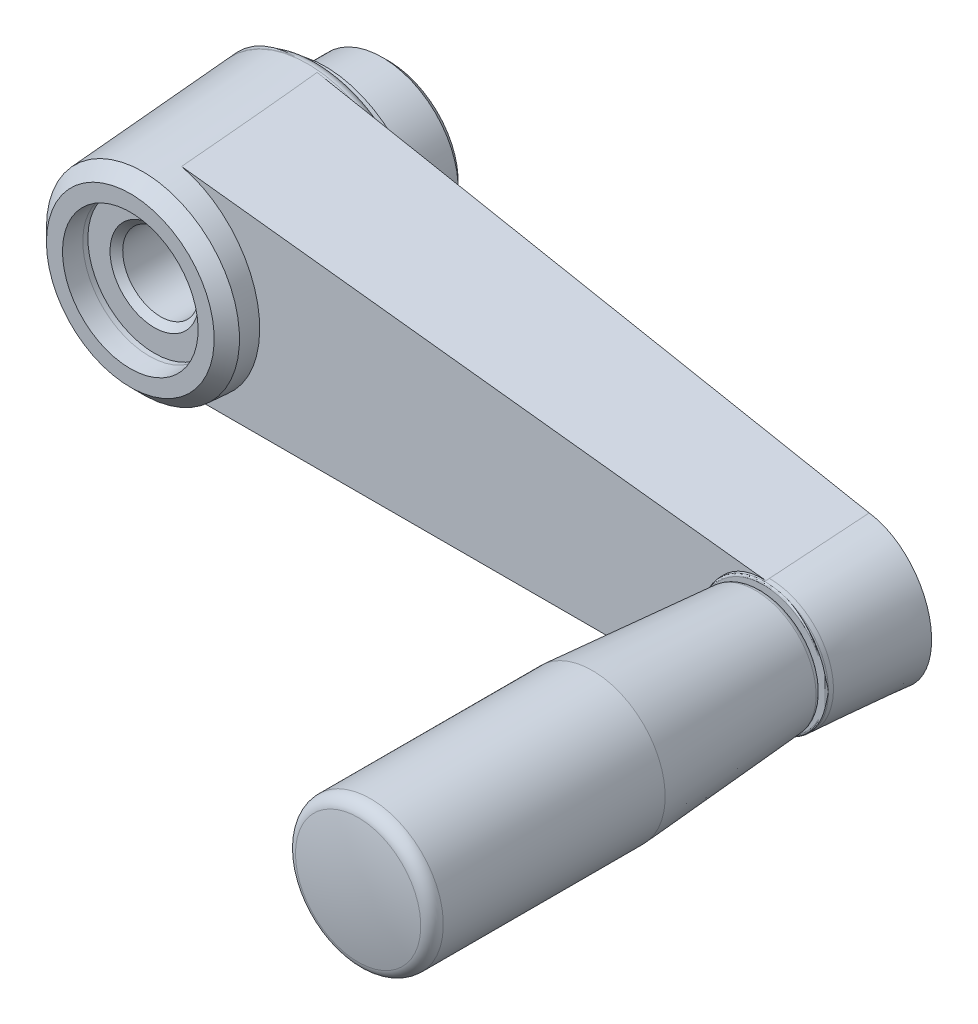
ISO-10303-21;
HEADER;
FILE_DESCRIPTION(('STEP AP214'),'2;1');
FILE_NAME('part.step','',(''),(''),'','','');
FILE_SCHEMA(('AUTOMOTIVE_DESIGN { 1 0 10303 214 1 1 1 1 }'));
ENDSEC;
DATA;
#1=APPLICATION_CONTEXT('core data for automotive mechanical design processes');
#2=APPLICATION_PROTOCOL_DEFINITION('international standard','automotive_design',2000,#1);
#3=PRODUCT_CONTEXT('',#1,'mechanical');
#4=PRODUCT('Part','Part','',(#3));
#5=PRODUCT_RELATED_PRODUCT_CATEGORY('part','',(#4));
#6=PRODUCT_DEFINITION_FORMATION('','',#4);
#7=PRODUCT_DEFINITION_CONTEXT('part definition',#1,'design');
#8=PRODUCT_DEFINITION('design','',#6,#7);
#9=PRODUCT_DEFINITION_SHAPE('','',#8);
#10=(LENGTH_UNIT() NAMED_UNIT(*) SI_UNIT(.MILLI.,.METRE.));
#11=(NAMED_UNIT(*) PLANE_ANGLE_UNIT() SI_UNIT($,.RADIAN.));
#12=(NAMED_UNIT(*) SI_UNIT($,.STERADIAN.) SOLID_ANGLE_UNIT());
#13=UNCERTAINTY_MEASURE_WITH_UNIT(LENGTH_MEASURE(1.E-05),#10,'distance_accuracy_value','');
#14=(GEOMETRIC_REPRESENTATION_CONTEXT(3) GLOBAL_UNCERTAINTY_ASSIGNED_CONTEXT((#13)) GLOBAL_UNIT_ASSIGNED_CONTEXT((#10,
#11,#12)) REPRESENTATION_CONTEXT('',''));
#15=CARTESIAN_POINT('',(0.,0.,0.));
#16=DIRECTION('',(0.,0.,1.));
#17=DIRECTION('',(1.,0.,0.));
#18=AXIS2_PLACEMENT_3D('',#15,#16,#17);
#19=CARTESIAN_POINT('',(0.,0.,40.8));
#20=DIRECTION('',(0.,0.,1.));
#21=DIRECTION('',(-1.,0.,0.));
#22=AXIS2_PLACEMENT_3D('',#19,#20,#21);
#23=PLANE('',#22);
#24=CARTESIAN_POINT('',(0.,0.,40.8));
#25=DIRECTION('',(0.,0.,1.));
#26=DIRECTION('',(-1.,0.,0.));
#27=AXIS2_PLACEMENT_3D('',#24,#25,#26);
#28=CIRCLE('',#27,13.2500000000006);
#29=CARTESIAN_POINT('',(-13.2500000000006,0.,40.8));
#30=VERTEX_POINT('',#29);
#31=EDGE_CURVE('E135',#30,#30,#28,.T.);
#32=ORIENTED_EDGE('',*,*,#31,.T.);
#33=EDGE_LOOP('',(#32));
#34=FACE_BOUND('',#33,.T.);
#35=CARTESIAN_POINT('',(0.,0.,40.8));
#36=DIRECTION('',(0.,0.,1.));
#37=DIRECTION('',(0.,-1.,0.));
#38=AXIS2_PLACEMENT_3D('',#35,#36,#37);
#39=CIRCLE('',#38,10.7097804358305);
#40=CARTESIAN_POINT('',(0.,-10.7097804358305,40.8));
#41=VERTEX_POINT('',#40);
#42=EDGE_CURVE('E501',#41,#41,#39,.T.);
#43=ORIENTED_EDGE('',*,*,#42,.F.);
#44=EDGE_LOOP('',(#43));
#45=FACE_BOUND('',#44,.T.);
#46=ADVANCED_FACE('F14',(#34,#45),#23,.T.);
#47=CARTESIAN_POINT('',(-17.120714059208,-17.,10.9912677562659));
#48=DIRECTION('',(-0.110890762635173,0.,0.993832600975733));
#49=DIRECTION('',(-0.993832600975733,0.,-0.110890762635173));
#50=AXIS2_PLACEMENT_3D('',#47,#48,#49);
#51=PLANE('',#50);
#52=DIRECTION('',(0.992175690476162,0.0577200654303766,0.110705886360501));
#53=VECTOR('',#52,1.);
#54=CARTESIAN_POINT('',(-17.0644220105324,-17.9796757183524,10.9975487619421));
#55=LINE('',#54,#53);
#56=CARTESIAN_POINT('',(1.813804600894,-16.8814302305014,13.1039607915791));
#57=VERTEX_POINT('',#56);
#58=CARTESIAN_POINT('',(99.977459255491,-11.1707354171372,24.0569548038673));
#59=VERTEX_POINT('',#58);
#60=EDGE_CURVE('E363',#57,#59,#55,.T.);
#61=ORIENTED_EDGE('',*,*,#60,.F.);
#62=CARTESIAN_POINT('',(-0.127550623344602,0.,12.8873464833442));
#63=DIRECTION('',(-0.110890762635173,0.,0.993832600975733));
#64=DIRECTION('',(-0.993832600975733,0.,-0.110890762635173));
#65=AXIS2_PLACEMENT_3D('',#62,#63,#64);
#66=ELLIPSE('',#65,17.0986174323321,16.9926847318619);
#67=CARTESIAN_POINT('',(1.813804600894,16.8814302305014,13.1039607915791));
#68=VERTEX_POINT('',#67);
#69=EDGE_CURVE('E9',#57,#68,#66,.T.);
#70=ORIENTED_EDGE('',*,*,#69,.T.);
#71=DIRECTION('',(-0.992175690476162,0.0577200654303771,-0.110705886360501));
#72=VECTOR('',#71,1.);
#73=CARTESIAN_POINT('',(-15.11729485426,17.8664011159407,11.2148070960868));
#74=LINE('',#73,#72);
#75=CARTESIAN_POINT('',(99.9774592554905,11.1707354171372,24.0569548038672));
#76=VERTEX_POINT('',#75);
#77=EDGE_CURVE('E366',#76,#68,#74,.T.);
#78=ORIENTED_EDGE('',*,*,#77,.F.);
#79=CARTESIAN_POINT('',(99.9128378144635,0.,24.0497444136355));
#80=DIRECTION('',(-0.110890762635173,0.,0.993832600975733));
#81=DIRECTION('',(-0.993832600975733,0.,-0.110890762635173));
#82=AXIS2_PLACEMENT_3D('',#79,#80,#81);
#83=ELLIPSE('',#82,11.2405875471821,11.1709223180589);
#84=EDGE_CURVE('E275',#59,#76,#83,.T.);
#85=ORIENTED_EDGE('',*,*,#84,.F.);
#86=EDGE_LOOP('',(#61,#70,#78,#85));
#87=FACE_BOUND('',#86,.T.);
#88=ADVANCED_FACE('F294',(#87),#51,.F.);
#89=CARTESIAN_POINT('',(108.700877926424,-17.,40.8));
#90=DIRECTION('',(0.0534734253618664,0.,-0.998569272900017));
#91=DIRECTION('',(0.998569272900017,0.,0.0534734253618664));
#92=AXIS2_PLACEMENT_3D('',#89,#90,#91);
#93=PLANE('',#92);
#94=DIRECTION('',(0.997114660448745,-0.0539561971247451,0.0533955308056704));
#95=VECTOR('',#94,1.);
#96=CARTESIAN_POINT('',(110.129772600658,9.48180541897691,40.876517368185));
#97=LINE('',#96,#95);
#98=CARTESIAN_POINT('',(2.40116527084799,15.3112513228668,35.1076460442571));
#99=VERTEX_POINT('',#98);
#100=CARTESIAN_POINT('',(99.9502317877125,10.0326440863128,40.3314025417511));
#101=VERTEX_POINT('',#100);
#102=EDGE_CURVE('E390',#99,#101,#97,.T.);
#103=ORIENTED_EDGE('',*,*,#102,.F.);
#104=CARTESIAN_POINT('',(-0.0558625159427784,0.,34.9760721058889));
#105=DIRECTION('',(0.0534734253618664,0.,-0.998569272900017));
#106=DIRECTION('',(-0.998569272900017,0.,-0.0534734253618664));
#107=AXIS2_PLACEMENT_3D('',#104,#105,#106);
#108=ELLIPSE('',#107,15.5294568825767,15.5071378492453);
#109=CARTESIAN_POINT('',(2.40116527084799,-15.3112513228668,35.1076460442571));
#110=VERTEX_POINT('',#109);
#111=EDGE_CURVE('E145',#99,#110,#108,.T.);
#112=ORIENTED_EDGE('',*,*,#111,.T.);
#113=DIRECTION('',(-0.997114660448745,-0.0539561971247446,-0.0533955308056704));
#114=VECTOR('',#113,1.);
#115=CARTESIAN_POINT('',(108.300555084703,-9.58078864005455,40.7785626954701));
#116=LINE('',#115,#114);
#117=CARTESIAN_POINT('',(99.9502317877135,-10.0326440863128,40.3314025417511));
#118=VERTEX_POINT('',#117);
#119=EDGE_CURVE('E392',#118,#110,#116,.T.);
#120=ORIENTED_EDGE('',*,*,#119,.F.);
#121=CARTESIAN_POINT('',(99.962431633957,0.,40.3320558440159));
#122=DIRECTION('',(0.0534734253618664,0.,-0.998569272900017));
#123=DIRECTION('',(-0.998569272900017,0.,-0.0534734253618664));
#124=AXIS2_PLACEMENT_3D('',#121,#122,#123);
#125=ELLIPSE('',#124,10.0470964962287,10.0326515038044);
#126=EDGE_CURVE('E232',#118,#101,#125,.T.);
#127=ORIENTED_EDGE('',*,*,#126,.T.);
#128=EDGE_LOOP('',(#103,#112,#120,#127));
#129=FACE_BOUND('',#128,.T.);
#130=ADVANCED_FACE('F245',(#129),#93,.F.);
#131=CARTESIAN_POINT('',(100.,-12.0844,10.9912677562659));
#132=DIRECTION('',(0.0501767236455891,-0.996301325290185,0.0697564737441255));
#133=DIRECTION('',(0.,-0.0698444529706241,-0.997557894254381));
#134=AXIS2_PLACEMENT_3D('',#131,#132,#133);
#135=PLANE('',#134);
#136=CARTESIAN_POINT('',(0.435789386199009,-8.6529671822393,131.618737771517));
#137=DIRECTION('',(0.0501767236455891,-0.996301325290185,0.0697564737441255));
#138=DIRECTION('',(0.00350869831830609,-0.0696681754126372,-0.997564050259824));
#139=AXIS2_PLACEMENT_3D('',#136,#137,#138);
#140=ELLIPSE('',#139,129.106506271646,2.4585658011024);
#141=EDGE_CURVE('E143',#57,#110,#140,.T.);
#142=ORIENTED_EDGE('',*,*,#141,.F.);
#143=ORIENTED_EDGE('',*,*,#60,.T.);
#144=CARTESIAN_POINT('',(99.9500238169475,-9.99984550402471,40.8));
#145=CARTESIAN_POINT('',(99.9599115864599,-10.4346151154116,34.5832626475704));
#146=CARTESIAN_POINT('',(99.9701340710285,-10.8693679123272,28.3665246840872));
#147=CARTESIAN_POINT('',(99.9870076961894,-11.5642086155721,18.430280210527));
#148=CARTESIAN_POINT('',(99.9934439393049,-11.8243073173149,14.7107740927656));
#149=CARTESIAN_POINT('',(100.,-12.0844,10.9912677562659));
#150=B_SPLINE_CURVE_WITH_KNOTS('',3,(#144,#145,#146,#147,#148,#149),.UNSPECIFIED.,.F.,.F.,(4,2,
4),(0.,18.6957885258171,29.8815726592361),.UNSPECIFIED.);
#151=CARTESIAN_POINT('',(99.9516205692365,-10.0701443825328,39.7948031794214));
#152=VERTEX_POINT('',#151);
#153=EDGE_CURVE('E249',#152,#59,#150,.T.);
#154=ORIENTED_EDGE('',*,*,#153,.F.);
#155=DIRECTION('',(-0.998734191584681,-0.0502992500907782,0.));
#156=VECTOR('',#155,1.);
#157=CARTESIAN_POINT('',(99.898690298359,-10.072810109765,39.7948031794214));
#158=LINE('',#157,#156);
#159=CARTESIAN_POINT('',(99.9510840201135,-10.0701714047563,39.7948031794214));
#160=VERTEX_POINT('',#159);
#161=EDGE_CURVE('E349',#152,#160,#158,.T.);
#162=ORIENTED_EDGE('',*,*,#161,.T.);
#163=CARTESIAN_POINT('',(99.95023142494,-10.0326280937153,40.3316312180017));
#164=CARTESIAN_POINT('',(99.950373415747,-10.0388876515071,40.2421265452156));
#165=CARTESIAN_POINT('',(99.9505154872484,-10.0451472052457,40.1526218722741));
#166=CARTESIAN_POINT('',(99.9507997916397,-10.0576663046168,39.9736125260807));
#167=CARTESIAN_POINT('',(99.9509420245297,-10.0639258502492,39.8841078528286));
#168=CARTESIAN_POINT('',(99.951084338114,-10.0701853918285,39.7946031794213));
#169=B_SPLINE_CURVE_WITH_KNOTS('',3,(#163,#164,#165,#166,#167,#168),.UNSPECIFIED.,.F.,.F.,(4,2,
4),(0.,0.269170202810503,0.538340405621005),.UNSPECIFIED.);
#170=EDGE_CURVE('E223',#118,#160,#169,.T.);
#171=ORIENTED_EDGE('',*,*,#170,.F.);
#172=ORIENTED_EDGE('',*,*,#119,.T.);
#173=EDGE_LOOP('',(#142,#143,#154,#162,#171,#172));
#174=FACE_BOUND('',#173,.T.);
#175=ADVANCED_FACE('F240',(#174),#135,.T.);
#176=CARTESIAN_POINT('',(0.,17.1207,10.9912677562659));
#177=DIRECTION('',(0.0501767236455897,0.996301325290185,0.0697564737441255));
#178=DIRECTION('',(0.,-0.0698444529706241,0.997557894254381));
#179=AXIS2_PLACEMENT_3D('',#176,#177,#178);
#180=PLANE('',#179);
#181=CARTESIAN_POINT('',(0.435789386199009,8.6529671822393,131.618737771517));
#182=DIRECTION('',(0.0501767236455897,0.996301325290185,0.0697564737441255));
#183=DIRECTION('',(0.00350869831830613,0.0696681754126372,-0.997564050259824));
#184=AXIS2_PLACEMENT_3D('',#181,#182,#183);
#185=ELLIPSE('',#184,129.106506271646,2.4585658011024);
#186=EDGE_CURVE('E141',#99,#68,#185,.T.);
#187=ORIENTED_EDGE('',*,*,#186,.F.);
#188=ORIENTED_EDGE('',*,*,#102,.T.);
#189=CARTESIAN_POINT('',(99.951084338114,10.0701853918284,39.7946031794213));
#190=CARTESIAN_POINT('',(99.9509420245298,10.0639258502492,39.8841078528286));
#191=CARTESIAN_POINT('',(99.9507997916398,10.0576663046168,39.9736125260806));
#192=CARTESIAN_POINT('',(99.9505154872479,10.0451472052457,40.1526218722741));
#193=CARTESIAN_POINT('',(99.9503734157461,10.0388876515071,40.2421265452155));
#194=CARTESIAN_POINT('',(99.9502314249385,10.0326280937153,40.3316312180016));
#195=B_SPLINE_CURVE_WITH_KNOTS('',3,(#189,#190,#191,#192,#193,#194),.UNSPECIFIED.,.F.,.F.,(4,2,
4),(0.,0.26917020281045,0.538340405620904),.UNSPECIFIED.);
#196=CARTESIAN_POINT('',(99.9510840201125,10.0701714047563,39.7948031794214));
#197=VERTEX_POINT('',#196);
#198=EDGE_CURVE('E119',#197,#101,#195,.T.);
#199=ORIENTED_EDGE('',*,*,#198,.F.);
#200=DIRECTION('',(0.998734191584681,-0.0502992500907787,0.));
#201=VECTOR('',#200,1.);
#202=CARTESIAN_POINT('',(-0.1013097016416,15.1091101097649,39.7948031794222));
#203=LINE('',#202,#201);
#204=CARTESIAN_POINT('',(99.9516205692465,10.0701443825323,39.7948031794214));
#205=VERTEX_POINT('',#204);
#206=EDGE_CURVE('E355',#197,#205,#203,.T.);
#207=ORIENTED_EDGE('',*,*,#206,.T.);
#208=CARTESIAN_POINT('',(99.950023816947,9.9998455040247,40.8));
#209=CARTESIAN_POINT('',(99.9599115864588,10.4346151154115,34.5832626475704));
#210=CARTESIAN_POINT('',(99.9701340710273,10.8693679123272,28.3665246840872));
#211=CARTESIAN_POINT('',(99.9870076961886,11.5642086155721,18.430280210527));
#212=CARTESIAN_POINT('',(99.9934439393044,11.8243073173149,14.7107740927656));
#213=CARTESIAN_POINT('',(100.,12.0844,10.9912677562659));
#214=B_SPLINE_CURVE_WITH_KNOTS('',3,(#208,#209,#210,#211,#212,#213),.UNSPECIFIED.,.F.,.F.,(4,2,
4),(0.,18.6957885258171,29.8815726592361),.UNSPECIFIED.);
#215=EDGE_CURVE('E234',#205,#76,#214,.T.);
#216=ORIENTED_EDGE('',*,*,#215,.T.);
#217=ORIENTED_EDGE('',*,*,#77,.T.);
#218=EDGE_LOOP('',(#187,#188,#199,#207,#216,#217));
#219=FACE_BOUND('',#218,.T.);
#220=ADVANCED_FACE('F244',(#219),#180,.T.);
#221=CARTESIAN_POINT('',(100.,0.,10.9912677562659));
#222=DIRECTION('',(0.,0.,-1.));
#223=DIRECTION('',(0.,1.,0.));
#224=AXIS2_PLACEMENT_3D('',#221,#222,#223);
#225=CONICAL_SURFACE('',#224,12.0844,0.0698131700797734);
#226=ORIENTED_EDGE('',*,*,#215,.F.);
#227=CARTESIAN_POINT('',(100.,0.,39.7948031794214));
#228=DIRECTION('',(0.,0.,1.));
#229=DIRECTION('',(-1.,0.,0.));
#230=AXIS2_PLACEMENT_3D('',#227,#228,#229);
#231=CIRCLE('',#230,10.0702605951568);
#232=EDGE_CURVE('E351',#205,#152,#231,.F.);
#233=ORIENTED_EDGE('',*,*,#232,.T.);
#234=ORIENTED_EDGE('',*,*,#153,.T.);
#235=ORIENTED_EDGE('',*,*,#84,.T.);
#236=EDGE_LOOP('',(#226,#233,#234,#235));
#237=FACE_BOUND('',#236,.T.);
#238=ADVANCED_FACE('F210',(#237),#225,.T.);
#239=CARTESIAN_POINT('',(100.,0.,40.5209269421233));
#240=DIRECTION('',(0.,0.,-1.));
#241=DIRECTION('',(1.,0.,0.));
#242=AXIS2_PLACEMENT_3D('',#239,#240,#241);
#243=CONICAL_SURFACE('',#242,10.0195146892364,0.0698131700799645);
#244=CARTESIAN_POINT('',(100.,0.,40.5209269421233));
#245=DIRECTION('',(0.,0.,1.));
#246=DIRECTION('',(-1.,0.,0.));
#247=AXIS2_PLACEMENT_3D('',#244,#245,#246);
#248=CIRCLE('',#247,10.0195146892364);
#249=CARTESIAN_POINT('',(89.9804853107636,0.,40.5209269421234));
#250=VERTEX_POINT('',#249);
#251=EDGE_CURVE('E172',#250,#250,#248,.T.);
#252=ORIENTED_EDGE('',*,*,#251,.F.);
#253=EDGE_LOOP('',(#252));
#254=FACE_BOUND('',#253,.T.);
#255=ORIENTED_EDGE('',*,*,#126,.F.);
#256=ORIENTED_EDGE('',*,*,#170,.T.);
#257=CARTESIAN_POINT('',(100.,0.,39.7948031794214));
#258=DIRECTION('',(0.,0.,1.));
#259=DIRECTION('',(-1.,0.,0.));
#260=AXIS2_PLACEMENT_3D('',#257,#258,#259);
#261=CIRCLE('',#260,10.0702902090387);
#262=EDGE_CURVE('E175',#160,#197,#261,.T.);
#263=ORIENTED_EDGE('',*,*,#262,.T.);
#264=ORIENTED_EDGE('',*,*,#198,.T.);
#265=EDGE_LOOP('',(#255,#256,#263,#264));
#266=FACE_BOUND('',#265,.T.);
#267=ADVANCED_FACE('F202',(#254,#266),#243,.T.);
#268=CARTESIAN_POINT('',(100.,0.,40.5));
#269=DIRECTION('',(0.,0.,1.));
#270=DIRECTION('',(-1.,0.,0.));
#271=AXIS2_PLACEMENT_3D('',#268,#269,#270);
#272=TOROIDAL_SURFACE('',#271,9.72024547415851,0.299999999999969);
#273=ORIENTED_EDGE('',*,*,#251,.T.);
#274=EDGE_LOOP('',(#273));
#275=FACE_BOUND('',#274,.T.);
#276=CARTESIAN_POINT('',(103.485698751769,-8.75239599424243,40.5207269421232));
#277=CARTESIAN_POINT('',(103.671639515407,-8.67909736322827,40.530684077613));
#278=CARTESIAN_POINT('',(103.85542663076,-8.60031708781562,40.540525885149));
#279=CARTESIAN_POINT('',(104.218364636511,-8.43192866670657,40.5599612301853));
#280=CARTESIAN_POINT('',(104.397507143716,-8.34230240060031,40.5695543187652));
#281=CARTESIAN_POINT('',(104.750212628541,-8.15259687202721,40.5884417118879));
#282=CARTESIAN_POINT('',(104.923774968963,-8.05251642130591,40.5977359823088));
#283=CARTESIAN_POINT('',(105.264680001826,-7.84226396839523,40.6159914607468));
#284=CARTESIAN_POINT('',(105.43202304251,-7.73209253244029,40.6249526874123));
#285=CARTESIAN_POINT('',(105.75992207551,-7.50204783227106,40.6425116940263));
#286=CARTESIAN_POINT('',(105.920478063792,-7.38217456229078,40.6511094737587));
#287=CARTESIAN_POINT('',(106.234275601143,-7.13316898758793,40.6679133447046));
#288=CARTESIAN_POINT('',(106.387516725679,-7.00403614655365,40.6761194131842));
#289=CARTESIAN_POINT('',(106.686171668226,-6.7370440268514,40.6921123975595));
#290=CARTESIAN_POINT('',(106.831586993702,-6.59918644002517,40.6998993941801));
#291=CARTESIAN_POINT('',(107.087285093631,-6.34236346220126,40.7135920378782));
#292=CARTESIAN_POINT('',(107.198981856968,-6.22480465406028,40.7195734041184));
#293=CARTESIAN_POINT('',(107.420562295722,-5.98062735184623,40.7314390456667));
#294=CARTESIAN_POINT('',(107.530257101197,-5.85383694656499,40.7373132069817));
#295=CARTESIAN_POINT('',(107.749569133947,-5.58829756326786,40.7490573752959));
#296=CARTESIAN_POINT('',(107.85885441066,-5.44927373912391,40.7549096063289));
#297=CARTESIAN_POINT('',(108.023274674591,-5.23040047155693,40.7637143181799));
#298=CARTESIAN_POINT('',(108.080581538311,-5.15217251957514,40.7667831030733));
#299=CARTESIAN_POINT('',(108.193526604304,-4.99451740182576,40.7728313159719));
#300=CARTESIAN_POINT('',(108.249164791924,-4.91509022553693,40.7758107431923));
#301=CARTESIAN_POINT('',(108.337892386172,-4.78646428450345,40.7805621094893));
#302=CARTESIAN_POINT('',(108.371342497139,-4.73751279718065,40.7823533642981));
#303=CARTESIAN_POINT('',(108.438080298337,-4.63949968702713,40.7859271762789));
#304=CARTESIAN_POINT('',(108.471367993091,-4.59043806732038,40.7877097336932));
#305=CARTESIAN_POINT('',(108.52149174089,-4.51756781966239,40.7903938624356));
#306=CARTESIAN_POINT('',(108.538091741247,-4.49359614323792,40.7912827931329));
#307=CARTESIAN_POINT('',(108.57170060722,-4.44594387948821,40.7930825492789));
#308=CARTESIAN_POINT('',(108.588709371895,-4.42226322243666,40.7939933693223));
#309=CARTESIAN_POINT('',(108.618826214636,-4.38232829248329,40.7956061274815));
#310=CARTESIAN_POINT('',(108.631669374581,-4.36587580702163,40.7962938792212));
#311=CARTESIAN_POINT('',(108.651960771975,-4.34254431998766,40.7973804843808));
#312=CARTESIAN_POINT('',(108.658745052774,-4.33513257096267,40.7977437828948));
#313=CARTESIAN_POINT('',(108.668692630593,-4.32588734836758,40.7982764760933));
#314=CARTESIAN_POINT('',(108.671371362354,-4.32353755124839,40.7984199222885));
#315=CARTESIAN_POINT('',(108.676774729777,-4.31929855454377,40.798709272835));
#316=CARTESIAN_POINT('',(108.679480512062,-4.31738794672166,40.7988541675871));
#317=CARTESIAN_POINT('',(108.683198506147,-4.31540575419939,40.7990532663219));
#318=CARTESIAN_POINT('',(108.684027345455,-4.31500055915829,40.7990976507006));
#319=CARTESIAN_POINT('',(108.685724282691,-4.31428040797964,40.7991885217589));
#320=CARTESIAN_POINT('',(108.686592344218,-4.313965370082,40.7992350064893));
#321=CARTESIAN_POINT('',(108.6880621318,-4.31355999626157,40.7993137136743));
#322=CARTESIAN_POINT('',(108.688652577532,-4.31342963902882,40.7993453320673));
#323=CARTESIAN_POINT('',(108.689846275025,-4.31325282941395,40.7994092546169));
#324=CARTESIAN_POINT('',(108.690449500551,-4.31320621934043,40.7994415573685));
#325=CARTESIAN_POINT('',(108.691494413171,-4.31322323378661,40.799497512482));
#326=CARTESIAN_POINT('',(108.691936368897,-4.31326082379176,40.7995211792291));
#327=CARTESIAN_POINT('',(108.692808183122,-4.31340784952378,40.7995678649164));
#328=CARTESIAN_POINT('',(108.693238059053,-4.31351717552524,40.7995908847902));
#329=CARTESIAN_POINT('',(108.694073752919,-4.31381376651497,40.7996356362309));
#330=CARTESIAN_POINT('',(108.694479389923,-4.3140015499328,40.7996573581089));
#331=CARTESIAN_POINT('',(108.695248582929,-4.31444965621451,40.7996985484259));
#332=CARTESIAN_POINT('',(108.695612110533,-4.3147100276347,40.799718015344));
#333=CARTESIAN_POINT('',(108.696336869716,-4.31532979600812,40.7997568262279));
#334=CARTESIAN_POINT('',(108.696690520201,-4.31569798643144,40.7997757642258));
#335=CARTESIAN_POINT('',(108.697333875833,-4.31648646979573,40.7998102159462));
#336=CARTESIAN_POINT('',(108.697623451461,-4.31690686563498,40.7998257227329));
#337=CARTESIAN_POINT('',(108.698323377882,-4.31807432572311,40.7998632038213));
#338=CARTESIAN_POINT('',(108.698683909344,-4.31885087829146,40.7998825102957));
#339=CARTESIAN_POINT('',(108.699292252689,-4.32044649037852,40.7999150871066));
#340=CARTESIAN_POINT('',(108.699539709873,-4.32126567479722,40.799928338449));
#341=CARTESIAN_POINT('',(108.700385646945,-4.32461444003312,40.7999736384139));
#342=CARTESIAN_POINT('',(108.700668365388,-4.32721907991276,40.799988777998));
#343=CARTESIAN_POINT('',(108.700919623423,-4.33244317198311,40.800002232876));
#344=CARTESIAN_POINT('',(108.700885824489,-4.33506259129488,40.8000004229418));
#345=CARTESIAN_POINT('',(108.700260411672,-4.3495394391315,40.7999669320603));
#346=CARTESIAN_POINT('',(108.698118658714,-4.36130224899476,40.7998522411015));
#347=CARTESIAN_POINT('',(108.693095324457,-4.38459761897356,40.7995832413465));
#348=CARTESIAN_POINT('',(108.690212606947,-4.39612979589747,40.7994288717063));
#349=CARTESIAN_POINT('',(108.680905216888,-4.43034226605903,40.7989304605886));
#350=CARTESIAN_POINT('',(108.673782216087,-4.45284926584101,40.7985490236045));
#351=CARTESIAN_POINT('',(108.658735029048,-4.49759389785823,40.7977432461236));
#352=CARTESIAN_POINT('',(108.650809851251,-4.51983115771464,40.7973188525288));
#353=CARTESIAN_POINT('',(108.626218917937,-4.5861594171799,40.7960020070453));
#354=CARTESIAN_POINT('',(108.608713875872,-4.62994292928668,40.7950646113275));
#355=CARTESIAN_POINT('',(108.554180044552,-4.76048293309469,40.7921443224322));
#356=CARTESIAN_POINT('',(108.515147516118,-4.84638580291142,40.7900541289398));
#357=CARTESIAN_POINT('',(108.433400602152,-5.01646042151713,40.785676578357));
#358=CARTESIAN_POINT('',(108.390683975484,-5.10063107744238,40.7833891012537));
#359=CARTESIAN_POINT('',(108.302040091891,-5.26743063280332,40.7786422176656));
#360=CARTESIAN_POINT('',(108.256107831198,-5.35005686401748,40.7761825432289));
#361=CARTESIAN_POINT('',(108.161397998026,-5.5136323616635,40.771110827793));
#362=CARTESIAN_POINT('',(108.112620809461,-5.59458185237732,40.7684988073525));
#363=CARTESIAN_POINT('',(107.928198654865,-5.88941893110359,40.7586229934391));
#364=CARTESIAN_POINT('',(107.784274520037,-6.09818880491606,40.7509158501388));
#365=CARTESIAN_POINT('',(107.479290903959,-6.502920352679,40.7345839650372));
#366=CARTESIAN_POINT('',(107.318218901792,-6.69887249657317,40.7259585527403));
#367=CARTESIAN_POINT('',(106.980286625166,-7.07693565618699,40.7078622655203));
#368=CARTESIAN_POINT('',(106.803412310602,-7.25903409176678,40.6983906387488));
#369=CARTESIAN_POINT('',(106.435417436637,-7.60803928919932,40.6786844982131));
#370=CARTESIAN_POINT('',(106.244301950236,-7.77495141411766,40.6684502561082));
#371=CARTESIAN_POINT('',(105.881455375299,-8.06661533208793,40.6490198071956));
#372=CARTESIAN_POINT('',(105.711664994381,-8.19379808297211,40.6399275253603));
#373=CARTESIAN_POINT('',(105.363825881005,-8.43627805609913,40.6213007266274));
#374=CARTESIAN_POINT('',(105.185777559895,-8.55157586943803,40.6117662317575));
#375=CARTESIAN_POINT('',(104.822599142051,-8.76953979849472,40.5923180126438));
#376=CARTESIAN_POINT('',(104.637483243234,-8.87222965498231,40.5824050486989));
#377=CARTESIAN_POINT('',(104.260734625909,-9.0647190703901,40.5622301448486));
#378=CARTESIAN_POINT('',(104.069103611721,-9.15452196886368,40.5519682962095));
#379=CARTESIAN_POINT('',(103.746187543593,-9.29259230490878,40.5346761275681));
#380=CARTESIAN_POINT('',(103.616492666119,-9.34461305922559,40.5277309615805));
#381=CARTESIAN_POINT('',(103.485698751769,-9.39366050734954,40.5207269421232));
#382=B_SPLINE_CURVE_WITH_KNOTS('',3,(#276,#277,#278,#279,#280,#281,#282,#283,#284,#285,#286,
#287,#288,#289,#290,#291,#292,#293,#294,#295,#296,#297,#298,#299,#300,#301,#302,#303,#304,#305,
#306,#307,#308,#309,#310,#311,#312,#313,#314,#315,#316,#317,#318,#319,#320,#321,#322,#323,#324,
#325,#326,#327,#328,#329,#330,#331,#332,#333,#334,#335,#336,#337,#338,#339,#340,#341,#342,#343,
#344,#345,#346,#347,#348,#349,#350,#351,#352,#353,#354,#355,#356,#357,#358,#359,#360,#361,#362,
#363,#364,#365,#366,#367,#368,#369,#370,#371,#372,#373,#374,#375,#376,#377,#378,#379,#380,#381),
.UNSPECIFIED.,.F.,.F.,(4,2,2,2,2,2,2,2,2,2,2,2,2,2,2,2,2,2,2,2,2,2,2,2,2,2,2,2,2,2,2,2,2,2,2,2,
2,2,2,2,2,2,2,2,2,2,2,2,2,2,2,2,4),(0.,0.600258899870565,1.20153486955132,1.80287925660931,
2.40418992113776,3.00550094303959,3.60684682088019,4.20807644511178,4.69472429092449,
5.19781983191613,5.72841346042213,6.0194568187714,6.31050273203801,6.4884505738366,
6.66639343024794,6.75390924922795,6.8414036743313,6.90403671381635,6.93412792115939,
6.94482397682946,6.95470967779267,6.95747737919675,6.96024256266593,6.96205504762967,
6.96386411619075,6.96519175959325,6.96651737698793,6.96785189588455,6.96918730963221,
6.9707113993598,6.97223854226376,6.97479313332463,6.97735568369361,6.98515372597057,
6.99300942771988,7.02865037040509,7.06434629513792,7.13509558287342,7.20593341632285,
7.34737019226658,7.63038027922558,7.91356375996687,8.19719813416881,8.48079432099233,
9.24079513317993,10.0013547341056,10.7625969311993,11.5235692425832,12.160102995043,
12.7966050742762,13.4318896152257,14.0670092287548,14.4865950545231),.UNSPECIFIED.);
#383=CARTESIAN_POINT('',(108.700877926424,-4.33334690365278,40.8));
#384=VERTEX_POINT('',#383);
#385=CARTESIAN_POINT('',(103.567821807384,-9.36241671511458,40.5251246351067));
#386=VERTEX_POINT('',#385);
#387=EDGE_CURVE('E186',#384,#386,#382,.T.);
#388=ORIENTED_EDGE('',*,*,#387,.F.);
#389=CARTESIAN_POINT('',(100.,0.,40.8));
#390=DIRECTION('',(0.,0.,1.));
#391=DIRECTION('',(-1.,0.,0.));
#392=AXIS2_PLACEMENT_3D('',#389,#390,#391);
#393=CIRCLE('',#392,9.72024547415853);
#394=CARTESIAN_POINT('',(108.700877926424,4.33334690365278,40.8));
#395=VERTEX_POINT('',#394);
#396=EDGE_CURVE('E169',#395,#384,#393,.T.);
#397=ORIENTED_EDGE('',*,*,#396,.F.);
#398=CARTESIAN_POINT('',(103.485698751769,9.39366050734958,40.5207269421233));
#399=CARTESIAN_POINT('',(103.579268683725,9.35856720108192,40.5257376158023));
#400=CARTESIAN_POINT('',(103.672253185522,9.32196750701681,40.5307169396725));
#401=CARTESIAN_POINT('',(103.857036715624,9.2457611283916,40.5406121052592));
#402=CARTESIAN_POINT('',(103.948835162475,9.20615302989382,40.5455279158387));
#403=CARTESIAN_POINT('',(104.407762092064,8.99926969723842,40.5701034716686));
#404=CARTESIAN_POINT('',(104.765046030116,8.80932183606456,40.5892360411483));
#405=CARTESIAN_POINT('',(105.452704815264,8.3842497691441,40.6260601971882));
#406=CARTESIAN_POINT('',(105.783018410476,8.14902659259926,40.6437485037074));
#407=CARTESIAN_POINT('',(106.296636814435,7.73032316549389,40.6712527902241));
#408=CARTESIAN_POINT('',(106.489879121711,7.55892892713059,40.6816009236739));
#409=CARTESIAN_POINT('',(106.861512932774,7.20048671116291,40.7015019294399));
#410=CARTESIAN_POINT('',(107.039898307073,7.01343233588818,40.7110544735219));
#411=CARTESIAN_POINT('',(107.379947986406,6.62525743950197,40.7292641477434));
#412=CARTESIAN_POINT('',(107.541641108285,6.42416219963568,40.7379228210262));
#413=CARTESIAN_POINT('',(107.847044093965,6.00886163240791,40.7542771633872));
#414=CARTESIAN_POINT('',(107.990768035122,5.79466676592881,40.7619735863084));
#415=CARTESIAN_POINT('',(108.18921800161,5.46726023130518,40.7726005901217));
#416=CARTESIAN_POINT('',(108.25172396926,5.35871983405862,40.7759477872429));
#417=CARTESIAN_POINT('',(108.371352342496,5.13886216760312,40.7823538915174));
#418=CARTESIAN_POINT('',(108.428482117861,5.02754897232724,40.7854131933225));
#419=CARTESIAN_POINT('',(108.509185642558,4.85825838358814,40.7897348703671));
#420=CARTESIAN_POINT('',(108.53524561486,4.80146436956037,40.7911303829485));
#421=CARTESIAN_POINT('',(108.585361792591,4.68687155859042,40.7938141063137));
#422=CARTESIAN_POINT('',(108.609414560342,4.62907123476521,40.7951021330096));
#423=CARTESIAN_POINT('',(108.643009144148,4.54133159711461,40.7969011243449));
#424=CARTESIAN_POINT('',(108.653801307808,4.51188654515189,40.7974790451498));
#425=CARTESIAN_POINT('',(108.673952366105,4.4526632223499,40.7985581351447));
#426=CARTESIAN_POINT('',(108.683316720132,4.42288671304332,40.7990595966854));
#427=CARTESIAN_POINT('',(108.694918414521,4.37736600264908,40.7996808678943));
#428=CARTESIAN_POINT('',(108.69838041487,4.36203396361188,40.7998662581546));
#429=CARTESIAN_POINT('',(108.700481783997,4.34256187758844,40.7999787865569));
#430=CARTESIAN_POINT('',(108.700791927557,4.33861359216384,40.7999953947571));
#431=CARTESIAN_POINT('',(108.70094322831,4.33069869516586,40.8000034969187));
#432=CARTESIAN_POINT('',(108.700789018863,4.32673265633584,40.7999952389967));
#433=CARTESIAN_POINT('',(108.69972401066,4.3219344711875,40.7999382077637));
#434=CARTESIAN_POINT('',(108.699464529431,4.32097466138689,40.7999243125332));
#435=CARTESIAN_POINT('',(108.698801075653,4.31910790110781,40.7998887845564));
#436=CARTESIAN_POINT('',(108.698398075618,4.31820064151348,40.7998672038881));
#437=CARTESIAN_POINT('',(108.697653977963,4.31695700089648,40.7998273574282));
#438=CARTESIAN_POINT('',(108.697393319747,4.31657295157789,40.7998133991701));
#439=CARTESIAN_POINT('',(108.696819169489,4.31584596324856,40.7997826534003));
#440=CARTESIAN_POINT('',(108.696505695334,4.31550301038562,40.7997658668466));
#441=CARTESIAN_POINT('',(108.695819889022,4.31487234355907,40.7997291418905));
#442=CARTESIAN_POINT('',(108.695446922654,4.31458530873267,40.7997091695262));
#443=CARTESIAN_POINT('',(108.694652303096,4.31408978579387,40.7996666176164));
#444=CARTESIAN_POINT('',(108.694230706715,4.31388120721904,40.7996440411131));
#445=CARTESIAN_POINT('',(108.693407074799,4.31356978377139,40.7995999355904));
#446=CARTESIAN_POINT('',(108.693008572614,4.31345738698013,40.7995785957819));
#447=CARTESIAN_POINT('',(108.69219899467,4.31329630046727,40.79953524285));
#448=CARTESIAN_POINT('',(108.69178790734,4.31324767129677,40.7995132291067));
#449=CARTESIAN_POINT('',(108.690745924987,4.31319489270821,40.7994574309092));
#450=CARTESIAN_POINT('',(108.69011330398,4.31322766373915,40.7994235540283));
#451=CARTESIAN_POINT('',(108.688860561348,4.31338899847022,40.7993564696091));
#452=CARTESIAN_POINT('',(108.688240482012,4.31351784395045,40.7993232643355));
#453=CARTESIAN_POINT('',(108.686157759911,4.31407065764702,40.799211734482));
#454=CARTESIAN_POINT('',(108.684739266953,4.31465463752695,40.799135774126));
#455=CARTESIAN_POINT('',(108.681996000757,4.31601290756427,40.798988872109));
#456=CARTESIAN_POINT('',(108.680671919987,4.31678844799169,40.7989179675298));
#457=CARTESIAN_POINT('',(108.674615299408,4.3206556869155,40.7985936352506));
#458=CARTESIAN_POINT('',(108.670293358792,4.3243668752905,40.7983621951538));
#459=CARTESIAN_POINT('',(108.662004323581,4.33213602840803,40.7979183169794));
#460=CARTESIAN_POINT('',(108.658038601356,4.33619522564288,40.7977059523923));
#461=CARTESIAN_POINT('',(108.638841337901,4.35671676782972,40.7966779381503));
#462=CARTESIAN_POINT('',(108.624923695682,4.37440862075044,40.7959326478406));
#463=CARTESIAN_POINT('',(108.597768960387,4.41017651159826,40.794478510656));
#464=CARTESIAN_POINT('',(108.584530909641,4.42825195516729,40.7937696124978));
#465=CARTESIAN_POINT('',(108.545423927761,4.48273119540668,40.7916754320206));
#466=CARTESIAN_POINT('',(108.52006080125,4.51951833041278,40.7903172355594));
#467=CARTESIAN_POINT('',(108.469561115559,4.59324545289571,40.7876129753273));
#468=CARTESIAN_POINT('',(108.444424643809,4.63018549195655,40.7862669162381));
#469=CARTESIAN_POINT('',(108.394116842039,4.70406456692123,40.783572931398));
#470=CARTESIAN_POINT('',(108.368945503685,4.74100359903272,40.7822250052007));
#471=CARTESIAN_POINT('',(108.318415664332,4.81474666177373,40.7795191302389));
#472=CARTESIAN_POINT('',(108.293057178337,4.85155070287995,40.7781611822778));
#473=CARTESIAN_POINT('',(108.165033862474,5.03579882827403,40.771305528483));
#474=CARTESIAN_POINT('',(108.060164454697,5.18173616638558,40.7656897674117));
#475=CARTESIAN_POINT('',(107.843883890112,5.46869793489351,40.7541079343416));
#476=CARTESIAN_POINT('',(107.73247243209,5.60972213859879,40.7481418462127));
#477=CARTESIAN_POINT('',(107.502872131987,5.8861363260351,40.7358467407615));
#478=CARTESIAN_POINT('',(107.384683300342,6.02152631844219,40.7295177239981));
#479=CARTESIAN_POINT('',(107.141569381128,6.28609221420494,40.7164989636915));
#480=CARTESIAN_POINT('',(107.016644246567,6.41526807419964,40.7098092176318));
#481=CARTESIAN_POINT('',(106.686175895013,6.73966860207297,40.6921126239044));
#482=CARTESIAN_POINT('',(106.475746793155,6.92994538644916,40.6808441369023));
#483=CARTESIAN_POINT('',(106.039800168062,7.29234804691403,40.6574991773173));
#484=CARTESIAN_POINT('',(105.814281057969,7.46447200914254,40.645422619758));
#485=CARTESIAN_POINT('',(105.419202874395,7.74066395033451,40.6242661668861));
#486=CARTESIAN_POINT('',(105.253077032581,7.84969100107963,40.6153701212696));
#487=CARTESIAN_POINT('',(104.914699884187,8.05782542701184,40.5972500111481));
#488=CARTESIAN_POINT('',(104.742447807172,8.15693154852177,40.5880259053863));
#489=CARTESIAN_POINT('',(104.39224135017,8.34497031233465,40.5692723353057));
#490=CARTESIAN_POINT('',(104.214280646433,8.43389113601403,40.5597425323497));
#491=CARTESIAN_POINT('',(103.853489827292,8.60114684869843,40.5404221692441));
#492=CARTESIAN_POINT('',(103.670660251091,8.67948290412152,40.5306316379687));
#493=CARTESIAN_POINT('',(103.485698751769,8.75239599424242,40.5207269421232));
#494=B_SPLINE_CURVE_WITH_KNOTS('',3,(#398,#399,#400,#401,#402,#403,#404,#405,#406,#407,#408,
#409,#410,#411,#412,#413,#414,#415,#416,#417,#418,#419,#420,#421,#422,#423,#424,#425,#426,#427,
#428,#429,#430,#431,#432,#433,#434,#435,#436,#437,#438,#439,#440,#441,#442,#443,#444,#445,#446,
#447,#448,#449,#450,#451,#452,#453,#454,#455,#456,#457,#458,#459,#460,#461,#462,#463,#464,#465,
#466,#467,#468,#469,#470,#471,#472,#473,#474,#475,#476,#477,#478,#479,#480,#481,#482,#483,#484,
#485,#486,#487,#488,#489,#490,#491,#492,#493),.UNSPECIFIED.,.F.,.F.,(4,2,2,2,2,2,2,2,2,2,2,2,2,
2,2,2,2,2,2,2,2,2,2,2,2,2,2,2,2,2,2,2,2,2,2,2,2,2,2,2,2,2,2,2,2,2,2,4),(0.,0.300125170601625,
0.600392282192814,1.81185827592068,3.02600321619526,3.80070588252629,4.57572659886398,
5.34938615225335,6.12243575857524,6.49822083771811,6.87348304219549,7.06096550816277,
7.2487627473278,7.34282041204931,7.43650889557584,7.48344740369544,7.49533581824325,
7.50710600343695,7.51008272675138,7.51303965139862,7.51442904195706,7.51581796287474,
7.51722282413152,7.51862606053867,7.51986422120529,7.52110355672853,7.52299568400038,
7.52489338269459,7.52946554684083,7.53406837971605,7.55105056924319,7.56809560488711,
7.63547454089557,7.70275576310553,7.83682212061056,7.97093815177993,8.10509537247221,
8.23924195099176,8.77847767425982,9.31773824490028,9.85699798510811,10.3962614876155,
11.2470152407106,12.0978585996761,12.6942604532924,13.290737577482,13.8878999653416,
14.4849964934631),.UNSPECIFIED.);
#495=CARTESIAN_POINT('',(103.567821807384,9.36241671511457,40.5251246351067));
#496=VERTEX_POINT('',#495);
#497=EDGE_CURVE('E178',#496,#395,#494,.T.);
#498=ORIENTED_EDGE('',*,*,#497,.F.);
#499=CARTESIAN_POINT('',(100.,0.,40.5251246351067));
#500=DIRECTION('',(0.,0.,-1.));
#501=DIRECTION('',(0.,1.,0.));
#502=AXIS2_PLACEMENT_3D('',#499,#500,#501);
#503=CIRCLE('',#502,10.0191915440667);
#504=CARTESIAN_POINT('',(110.019191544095,5.23714958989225E-11,40.5251246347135));
#505=VERTEX_POINT('',#504);
#506=EDGE_CURVE('E360',#496,#505,#503,.T.);
#507=ORIENTED_EDGE('',*,*,#506,.T.);
#508=EDGE_CURVE('E369',#505,#386,#503,.T.);
#509=ORIENTED_EDGE('',*,*,#508,.T.);
#510=EDGE_LOOP('',(#388,#397,#498,#507,#509));
#511=FACE_BOUND('',#510,.T.);
#512=ADVANCED_FACE('F196',(#275,#511),#272,.T.);
#513=CARTESIAN_POINT('',(100.,0.,55.8));
#514=DIRECTION('',(0.,-1.,0.));
#515=DIRECTION('',(1.,0.,0.));
#516=AXIS2_PLACEMENT_3D('',#513,#514,#515);
#517=SPHERICAL_SURFACE('',#516,50.);
#518=CARTESIAN_POINT('',(100.,0.,55.8));
#519=DIRECTION('',(0.,0.,1.));
#520=DIRECTION('',(-1.,0.,0.));
#521=AXIS2_PLACEMENT_3D('',#518,#519,#520);
#522=SPHERICAL_SURFACE('',#521,50.);
#523=CARTESIAN_POINT('',(100.,0.,104.810942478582));
#524=DIRECTION('',(0.,0.,1.));
#525=DIRECTION('',(-1.,0.,0.));
#526=AXIS2_PLACEMENT_3D('',#523,#524,#525);
#527=CIRCLE('',#526,9.89583333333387);
#528=CARTESIAN_POINT('',(90.1041666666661,0.,104.810942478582));
#529=VERTEX_POINT('',#528);
#530=EDGE_CURVE('E148',#529,#529,#527,.T.);
#531=ORIENTED_EDGE('',*,*,#530,.T.);
#532=EDGE_LOOP('',(#531));
#533=FACE_BOUND('',#532,.T.);
#534=ADVANCED_FACE('F201',(#533),#522,.T.);
#535=CARTESIAN_POINT('',(100.,0.,39.7948031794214));
#536=DIRECTION('',(0.,0.,1.));
#537=DIRECTION('',(-1.,0.,0.));
#538=AXIS2_PLACEMENT_3D('',#535,#536,#537);
#539=PLANE('',#538);
#540=ORIENTED_EDGE('',*,*,#161,.F.);
#541=ORIENTED_EDGE('',*,*,#232,.F.);
#542=ORIENTED_EDGE('',*,*,#206,.F.);
#543=ORIENTED_EDGE('',*,*,#262,.F.);
#544=EDGE_LOOP('',(#540,#541,#542,#543));
#545=FACE_BOUND('',#544,.T.);
#546=ADVANCED_FACE('F212',(#545),#539,.F.);
#547=CARTESIAN_POINT('',(100.,0.,109.53978007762));
#548=DIRECTION('',(0.,0.,1.));
#549=DIRECTION('',(-1.,0.,0.));
#550=AXIS2_PLACEMENT_3D('',#547,#548,#549);
#551=CYLINDRICAL_SURFACE('',#550,6.);
#552=CARTESIAN_POINT('',(100.,0.,40.8));
#553=DIRECTION('',(0.,0.,1.));
#554=DIRECTION('',(-1.,0.,0.));
#555=AXIS2_PLACEMENT_3D('',#552,#553,#554);
#556=CIRCLE('',#555,6.00000000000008);
#557=CARTESIAN_POINT('',(93.9999999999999,0.,40.8000000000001));
#558=VERTEX_POINT('',#557);
#559=EDGE_CURVE('E166',#558,#558,#556,.T.);
#560=ORIENTED_EDGE('',*,*,#559,.T.);
#561=EDGE_LOOP('',(#560));
#562=FACE_BOUND('',#561,.T.);
#563=CARTESIAN_POINT('',(100.,0.,41.1));
#564=DIRECTION('',(0.,0.,1.));
#565=DIRECTION('',(-1.,0.,0.));
#566=AXIS2_PLACEMENT_3D('',#563,#564,#565);
#567=CIRCLE('',#566,6.00000000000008);
#568=CARTESIAN_POINT('',(93.9999999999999,0.,41.1));
#569=VERTEX_POINT('',#568);
#570=EDGE_CURVE('E163',#569,#569,#567,.T.);
#571=ORIENTED_EDGE('',*,*,#570,.F.);
#572=EDGE_LOOP('',(#571));
#573=FACE_BOUND('',#572,.T.);
#574=ADVANCED_FACE('F204',(#562,#573),#551,.T.);
#575=CARTESIAN_POINT('',(108.572104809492,0.,41.1));
#576=DIRECTION('',(0.,0.,-1.));
#577=DIRECTION('',(1.,0.,0.));
#578=AXIS2_PLACEMENT_3D('',#575,#576,#577);
#579=PLANE('',#578);
#580=ORIENTED_EDGE('',*,*,#570,.T.);
#581=EDGE_LOOP('',(#580));
#582=FACE_BOUND('',#581,.T.);
#583=CARTESIAN_POINT('',(100.,0.,41.1));
#584=DIRECTION('',(0.,0.,1.));
#585=DIRECTION('',(-1.,0.,0.));
#586=AXIS2_PLACEMENT_3D('',#583,#584,#585);
#587=CIRCLE('',#586,8.57210480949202);
#588=CARTESIAN_POINT('',(91.427895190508,0.,41.1000000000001));
#589=VERTEX_POINT('',#588);
#590=EDGE_CURVE('E160',#589,#589,#587,.T.);
#591=ORIENTED_EDGE('',*,*,#590,.F.);
#592=EDGE_LOOP('',(#591));
#593=FACE_BOUND('',#592,.T.);
#594=ADVANCED_FACE('F320',(#582,#593),#579,.T.);
#595=CARTESIAN_POINT('',(100.,0.,42.1));
#596=DIRECTION('',(0.,0.,1.));
#597=DIRECTION('',(-1.,0.,0.));
#598=AXIS2_PLACEMENT_3D('',#595,#596,#597);
#599=TOROIDAL_SURFACE('',#598,8.572104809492,1.);
#600=ORIENTED_EDGE('',*,*,#590,.T.);
#601=EDGE_LOOP('',(#600));
#602=FACE_BOUND('',#601,.T.);
#603=CARTESIAN_POINT('',(100.,0.,42.0253029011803));
#604=DIRECTION('',(0.,0.,1.));
#605=DIRECTION('',(-1.,0.,0.));
#606=AXIS2_PLACEMENT_3D('',#603,#604,#605);
#607=CIRCLE('',#606,9.56931107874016);
#608=CARTESIAN_POINT('',(90.4306889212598,0.,42.0253029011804));
#609=VERTEX_POINT('',#608);
#610=EDGE_CURVE('E157',#609,#609,#607,.T.);
#611=ORIENTED_EDGE('',*,*,#610,.F.);
#612=EDGE_LOOP('',(#611));
#613=FACE_BOUND('',#612,.T.);
#614=ADVANCED_FACE('F317',(#602,#613),#599,.T.);
#615=CARTESIAN_POINT('',(100.,0.,67.8));
#616=DIRECTION('',(0.,0.,1.));
#617=DIRECTION('',(-1.,0.,0.));
#618=AXIS2_PLACEMENT_3D('',#615,#616,#617);
#619=CONICAL_SURFACE('',#618,11.5000000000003,0.0747667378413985);
#620=ORIENTED_EDGE('',*,*,#610,.T.);
#621=EDGE_LOOP('',(#620));
#622=FACE_BOUND('',#621,.T.);
#623=CARTESIAN_POINT('',(100.,0.,67.8));
#624=DIRECTION('',(0.,0.,1.));
#625=DIRECTION('',(-1.,0.,0.));
#626=AXIS2_PLACEMENT_3D('',#623,#624,#625);
#627=CIRCLE('',#626,11.5000000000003);
#628=CARTESIAN_POINT('',(88.4999999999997,0.,67.8000000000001));
#629=VERTEX_POINT('',#628);
#630=EDGE_CURVE('E154',#629,#629,#627,.T.);
#631=ORIENTED_EDGE('',*,*,#630,.F.);
#632=EDGE_LOOP('',(#631));
#633=FACE_BOUND('',#632,.T.);
#634=ADVANCED_FACE('F313',(#622,#633),#619,.T.);
#635=CARTESIAN_POINT('',(100.,0.,109.53978007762));
#636=DIRECTION('',(0.,0.,1.));
#637=DIRECTION('',(-1.,0.,0.));
#638=AXIS2_PLACEMENT_3D('',#635,#636,#637);
#639=CYLINDRICAL_SURFACE('',#638,11.5000000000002);
#640=ORIENTED_EDGE('',*,*,#630,.T.);
#641=EDGE_LOOP('',(#640));
#642=FACE_BOUND('',#641,.T.);
#643=CARTESIAN_POINT('',(100.,0.,102.850504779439));
#644=DIRECTION('',(0.,0.,1.));
#645=DIRECTION('',(-1.,0.,0.));
#646=AXIS2_PLACEMENT_3D('',#643,#644,#645);
#647=CIRCLE('',#646,11.5000000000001);
#648=CARTESIAN_POINT('',(88.4999999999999,0.,102.850504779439));
#649=VERTEX_POINT('',#648);
#650=EDGE_CURVE('E151',#649,#649,#647,.T.);
#651=ORIENTED_EDGE('',*,*,#650,.F.);
#652=EDGE_LOOP('',(#651));
#653=FACE_BOUND('',#652,.T.);
#654=ADVANCED_FACE('F309',(#642,#653),#639,.T.);
#655=CARTESIAN_POINT('',(100.,0.,102.850504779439));
#656=DIRECTION('',(0.,0.,1.));
#657=DIRECTION('',(-1.,0.,0.));
#658=AXIS2_PLACEMENT_3D('',#655,#656,#657);
#659=TOROIDAL_SURFACE('',#658,9.50000000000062,1.9999999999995);
#660=ORIENTED_EDGE('',*,*,#650,.T.);
#661=EDGE_LOOP('',(#660));
#662=FACE_BOUND('',#661,.T.);
#663=ORIENTED_EDGE('',*,*,#530,.F.);
#664=EDGE_LOOP('',(#663));
#665=FACE_BOUND('',#664,.T.);
#666=ADVANCED_FACE('F279',(#662,#665),#659,.T.);
#667=CARTESIAN_POINT('',(109.720245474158,-17.,40.5));
#668=DIRECTION('',(0.,1.,0.));
#669=DIRECTION('',(-1.,0.,0.));
#670=AXIS2_PLACEMENT_3D('',#667,#668,#669);
#671=CYLINDRICAL_SURFACE('',#670,0.299999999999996);
#672=CARTESIAN_POINT('',(109.720045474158,2.34949437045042,40.7999999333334));
#673=CARTESIAN_POINT('',(109.73181549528,2.30080112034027,40.8000015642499));
#674=CARTESIAN_POINT('',(109.743264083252,2.25203617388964,40.7993236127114));
#675=CARTESIAN_POINT('',(109.765500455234,2.15439520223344,40.7967793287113));
#676=CARTESIAN_POINT('',(109.776288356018,2.10551919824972,40.7949132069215));
#677=CARTESIAN_POINT('',(109.80764346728,1.95873192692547,40.7877875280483));
#678=CARTESIAN_POINT('',(109.827198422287,1.86067653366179,40.7810007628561));
#679=CARTESIAN_POINT('',(109.862728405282,1.66867778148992,40.7646938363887));
#680=CARTESIAN_POINT('',(109.878823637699,1.5747446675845,40.7553080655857));
#681=CARTESIAN_POINT('',(109.908448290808,1.38671723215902,40.7343274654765));
#682=CARTESIAN_POINT('',(109.921977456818,1.29262289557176,40.7227324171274));
#683=CARTESIAN_POINT('',(109.958667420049,1.01029794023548,40.6853936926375));
#684=CARTESIAN_POINT('',(109.977956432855,0.821886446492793,40.6570830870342));
#685=CARTESIAN_POINT('',(109.998730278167,0.543218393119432,40.6127020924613));
#686=CARTESIAN_POINT('',(110.00425395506,0.453021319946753,40.5979489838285));
#687=CARTESIAN_POINT('',(110.012919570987,0.272406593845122,40.5676926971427));
#688=CARTESIAN_POINT('',(110.016055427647,0.181988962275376,40.5521877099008));
#689=CARTESIAN_POINT('',(110.018244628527,0.0762124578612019,40.5346857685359));
#690=CARTESIAN_POINT('',(110.018524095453,0.0609814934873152,40.532181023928));
#691=CARTESIAN_POINT('',(110.01887267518,0.0381319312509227,40.5286884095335));
#692=CARTESIAN_POINT('',(110.018976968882,0.0305291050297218,40.5275701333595));
#693=CARTESIAN_POINT('',(110.019135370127,0.0152615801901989,40.5258028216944));
#694=CARTESIAN_POINT('',(110.019189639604,0.007597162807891,40.5251522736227));
#695=CARTESIAN_POINT('',(110.019195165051,-0.0146158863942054,40.5250720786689));
#696=CARTESIAN_POINT('',(110.019009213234,-0.02913358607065,40.5272745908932));
#697=CARTESIAN_POINT('',(110.018566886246,-0.0581571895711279,40.5317961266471));
#698=CARTESIAN_POINT('',(110.018309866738,-0.0726617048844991,40.5341160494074));
#699=CARTESIAN_POINT('',(110.017718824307,-0.101938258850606,40.5389235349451));
#700=CARTESIAN_POINT('',(110.017383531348,-0.116710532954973,40.5414133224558));
#701=CARTESIAN_POINT('',(110.016648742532,-0.146202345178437,40.5463858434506));
#702=CARTESIAN_POINT('',(110.016249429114,-0.160921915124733,40.5488685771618));
#703=CARTESIAN_POINT('',(110.014918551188,-0.206277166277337,40.5565250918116));
#704=CARTESIAN_POINT('',(110.013878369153,-0.236911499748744,40.5617056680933));
#705=CARTESIAN_POINT('',(110.01152536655,-0.298024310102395,40.5719993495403));
#706=CARTESIAN_POINT('',(110.010213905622,-0.328502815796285,40.5771126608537));
#707=CARTESIAN_POINT('',(110.003122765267,-0.477659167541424,40.6020001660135));
#708=CARTESIAN_POINT('',(109.995395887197,-0.596320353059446,40.6213776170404));
#709=CARTESIAN_POINT('',(109.975787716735,-0.833781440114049,40.6585604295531));
#710=CARTESIAN_POINT('',(109.963898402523,-0.952581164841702,40.6763626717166));
#711=CARTESIAN_POINT('',(109.936112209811,-1.18904549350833,40.7094374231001));
#712=CARTESIAN_POINT('',(109.920249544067,-1.30671130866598,40.7247297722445));
#713=CARTESIAN_POINT('',(109.884511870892,-1.54176553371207,40.7520374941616));
#714=CARTESIAN_POINT('',(109.864639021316,-1.6591540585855,40.7640546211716));
#715=CARTESIAN_POINT('',(109.833870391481,-1.82422417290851,40.7778206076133));
#716=CARTESIAN_POINT('',(109.824618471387,-1.87206243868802,40.7814384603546));
#717=CARTESIAN_POINT('',(109.805463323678,-1.96766541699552,40.7878201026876));
#718=CARTESIAN_POINT('',(109.795560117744,-2.01543013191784,40.790583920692));
#719=CARTESIAN_POINT('',(109.764844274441,-2.15880284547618,40.7974025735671));
#720=CARTESIAN_POINT('',(109.743065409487,-2.25427513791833,40.799965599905));
#721=CARTESIAN_POINT('',(109.720045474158,-2.34949437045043,40.7999999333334));
#722=B_SPLINE_CURVE_WITH_KNOTS('',3,(#672,#673,#674,#675,#676,#677,#678,#679,#680,#681,#682,
#683,#684,#685,#686,#687,#688,#689,#690,#691,#692,#693,#694,#695,#696,#697,#698,#699,#700,#701,
#702,#703,#704,#705,#706,#707,#708,#709,#710,#711,#712,#713,#714,#715,#716,#717,#718,#719,#720,
#721),.UNSPECIFIED.,.F.,.F.,(4,2,2,2,2,2,2,2,2,2,2,2,2,2,2,2,2,2,2,2,2,2,2,2,4),(0.,
0.150271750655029,0.300516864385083,0.601053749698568,0.888278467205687,1.17553167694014,
1.74961315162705,2.02427337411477,2.29963090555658,2.345936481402,2.36900319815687,
2.39199498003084,2.43574087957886,2.47989719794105,2.52482702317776,2.56963101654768,
2.66288487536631,2.75568220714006,3.11703593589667,3.47908993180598,3.83812760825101,
4.19697260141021,4.3435400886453,4.49010269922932,4.78388355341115),.UNSPECIFIED.);
#723=CARTESIAN_POINT('',(109.720245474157,-2.34866678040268,40.8));
#724=VERTEX_POINT('',#723);
#725=EDGE_CURVE('E256',#505,#724,#722,.T.);
#726=ORIENTED_EDGE('',*,*,#725,.F.);
#727=CARTESIAN_POINT('',(109.720245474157,2.34866678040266,40.8));
#728=VERTEX_POINT('',#727);
#729=EDGE_CURVE('E268',#728,#505,#722,.T.);
#730=ORIENTED_EDGE('',*,*,#729,.F.);
#731=DIRECTION('',(0.,1.,0.));
#732=VECTOR('',#731,1.);
#733=CARTESIAN_POINT('',(109.720245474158,-17.,40.8));
#734=LINE('',#733,#732);
#735=EDGE_CURVE('E398',#724,#728,#734,.T.);
#736=ORIENTED_EDGE('',*,*,#735,.F.);
#737=EDGE_LOOP('',(#726,#730,#736));
#738=FACE_BOUND('',#737,.T.);
#739=ADVANCED_FACE('F262',(#738),#671,.T.);
#740=ORIENTED_EDGE('',*,*,#508,.F.);
#741=ORIENTED_EDGE('',*,*,#725,.T.);
#742=CARTESIAN_POINT('',(100.,0.,40.8));
#743=DIRECTION('',(0.,0.,1.));
#744=DIRECTION('',(-1.,0.,0.));
#745=AXIS2_PLACEMENT_3D('',#742,#743,#744);
#746=CIRCLE('',#745,9.99997038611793);
#747=CARTESIAN_POINT('',(108.700877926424,-4.92890769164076,40.8));
#748=VERTEX_POINT('',#747);
#749=EDGE_CURVE('E372',#748,#724,#746,.T.);
#750=ORIENTED_EDGE('',*,*,#749,.F.);
#751=CARTESIAN_POINT('',(99.9624317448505,0.,40.3320558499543));
#752=DIRECTION('',(0.0534734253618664,0.,-0.998569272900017));
#753=DIRECTION('',(-0.998569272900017,0.,-0.0534734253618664));
#754=AXIS2_PLACEMENT_3D('',#751,#752,#753);
#755=ELLIPSE('',#754,10.0470668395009,10.0326218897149);
#756=EDGE_CURVE('E391',#748,#386,#755,.T.);
#757=ORIENTED_EDGE('',*,*,#756,.T.);
#758=EDGE_LOOP('',(#740,#741,#750,#757));
#759=FACE_BOUND('',#758,.T.);
#760=ADVANCED_FACE('F258',(#759),#225,.T.);
#761=DIRECTION('',(0.,1.,0.));
#762=VECTOR('',#761,1.);
#763=CARTESIAN_POINT('',(108.700877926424,-17.,40.8));
#764=LINE('',#763,#762);
#765=EDGE_CURVE('E396',#748,#384,#764,.T.);
#766=ORIENTED_EDGE('',*,*,#765,.T.);
#767=ORIENTED_EDGE('',*,*,#387,.T.);
#768=ORIENTED_EDGE('',*,*,#756,.F.);
#769=EDGE_LOOP('',(#766,#767,#768));
#770=FACE_BOUND('',#769,.T.);
#771=ADVANCED_FACE('F261',(#770),#93,.F.);
#772=CARTESIAN_POINT('',(108.700877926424,-17.,40.8));
#773=DIRECTION('',(0.,0.,1.));
#774=DIRECTION('',(-1.,0.,0.));
#775=AXIS2_PLACEMENT_3D('',#772,#773,#774);
#776=PLANE('',#775);
#777=CARTESIAN_POINT('',(108.700877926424,4.92890769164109,40.8));
#778=VERTEX_POINT('',#777);
#779=EDGE_CURVE('E389',#395,#778,#764,.T.);
#780=ORIENTED_EDGE('',*,*,#779,.F.);
#781=ORIENTED_EDGE('',*,*,#396,.T.);
#782=ORIENTED_EDGE('',*,*,#765,.F.);
#783=ORIENTED_EDGE('',*,*,#749,.T.);
#784=ORIENTED_EDGE('',*,*,#735,.T.);
#785=CARTESIAN_POINT('',(100.,0.,40.8));
#786=DIRECTION('',(0.,0.,-1.));
#787=DIRECTION('',(0.,1.,0.));
#788=AXIS2_PLACEMENT_3D('',#785,#786,#787);
#789=CIRCLE('',#788,9.99997038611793);
#790=EDGE_CURVE('E231',#778,#728,#789,.T.);
#791=ORIENTED_EDGE('',*,*,#790,.F.);
#792=EDGE_LOOP('',(#780,#781,#782,#783,#784,#791));
#793=FACE_BOUND('',#792,.T.);
#794=ORIENTED_EDGE('',*,*,#559,.F.);
#795=EDGE_LOOP('',(#794));
#796=FACE_BOUND('',#795,.T.);
#797=ADVANCED_FACE('F281',(#793,#796),#776,.T.);
#798=ORIENTED_EDGE('',*,*,#506,.F.);
#799=EDGE_CURVE('E385',#496,#778,#755,.T.);
#800=ORIENTED_EDGE('',*,*,#799,.T.);
#801=ORIENTED_EDGE('',*,*,#790,.T.);
#802=ORIENTED_EDGE('',*,*,#729,.T.);
#803=EDGE_LOOP('',(#798,#800,#801,#802));
#804=FACE_BOUND('',#803,.T.);
#805=ADVANCED_FACE('F264',(#804),#225,.T.);
#806=ORIENTED_EDGE('',*,*,#799,.F.);
#807=ORIENTED_EDGE('',*,*,#497,.T.);
#808=ORIENTED_EDGE('',*,*,#779,.T.);
#809=EDGE_LOOP('',(#806,#807,#808));
#810=FACE_BOUND('',#809,.T.);
#811=ADVANCED_FACE('F192',(#810),#93,.F.);
#812=CARTESIAN_POINT('',(0.,0.,38.8));
#813=DIRECTION('',(0.,0.,-1.));
#814=DIRECTION('',(1.,0.,0.));
#815=AXIS2_PLACEMENT_3D('',#812,#813,#814);
#816=CONICAL_SURFACE('',#815,15.25,0.0671695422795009);
#817=CARTESIAN_POINT('',(0.,0.,38.8));
#818=DIRECTION('',(0.,0.,1.));
#819=DIRECTION('',(-1.,0.,0.));
#820=AXIS2_PLACEMENT_3D('',#817,#818,#819);
#821=CIRCLE('',#820,15.25);
#822=CARTESIAN_POINT('',(-15.25,0.,38.8));
#823=VERTEX_POINT('',#822);
#824=EDGE_CURVE('E126',#823,#823,#821,.T.);
#825=ORIENTED_EDGE('',*,*,#824,.F.);
#826=EDGE_LOOP('',(#825));
#827=FACE_BOUND('',#826,.T.);
#828=CARTESIAN_POINT('',(0.,0.,12.7816846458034));
#829=DIRECTION('',(0.,0.,1.));
#830=DIRECTION('',(-1.,0.,0.));
#831=AXIS2_PLACEMENT_3D('',#828,#829,#830);
#832=CIRCLE('',#831,17.000271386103);
#833=CARTESIAN_POINT('',(-17.000271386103,0.,12.7816846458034));
#834=VERTEX_POINT('',#833);
#835=EDGE_CURVE('E122',#834,#834,#832,.T.);
#836=ORIENTED_EDGE('',*,*,#835,.T.);
#837=EDGE_LOOP('',(#836));
#838=FACE_BOUND('',#837,.T.);
#839=ORIENTED_EDGE('',*,*,#111,.F.);
#840=ORIENTED_EDGE('',*,*,#186,.T.);
#841=ORIENTED_EDGE('',*,*,#69,.F.);
#842=ORIENTED_EDGE('',*,*,#141,.T.);
#843=EDGE_LOOP('',(#839,#840,#841,#842));
#844=FACE_BOUND('',#843,.T.);
#845=ADVANCED_FACE('F416',(#827,#838,#844),#816,.T.);
#846=CARTESIAN_POINT('',(0.,0.,12.6810060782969));
#847=DIRECTION('',(0.,0.,1.));
#848=DIRECTION('',(-1.,0.,0.));
#849=AXIS2_PLACEMENT_3D('',#846,#847,#848);
#850=TOROIDAL_SURFACE('',#849,15.5036539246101,1.50000000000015);
#851=ORIENTED_EDGE('',*,*,#835,.F.);
#852=EDGE_LOOP('',(#851));
#853=FACE_BOUND('',#852,.T.);
#854=CARTESIAN_POINT('',(-15.3373177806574,0.,11.1902571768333));
#855=CARTESIAN_POINT('',(-15.3347656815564,0.0246593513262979,11.1905419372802));
#856=CARTESIAN_POINT('',(-15.3321546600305,0.0493133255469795,11.1908332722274));
#857=CARTESIAN_POINT('',(-15.2753417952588,0.573805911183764,11.1971723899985));
#858=CARTESIAN_POINT('',(-15.1969886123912,1.07130472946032,11.2059149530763));
#859=CARTESIAN_POINT('',(-14.9926465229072,2.05651414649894,11.2287152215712));
#860=CARTESIAN_POINT('',(-14.8666241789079,2.54421762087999,11.2427766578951));
#861=CARTESIAN_POINT('',(-14.5895128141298,3.43643505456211,11.2736964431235));
#862=CARTESIAN_POINT('',(-14.4445678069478,3.84288820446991,11.2898692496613));
#863=CARTESIAN_POINT('',(-14.121583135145,4.6424071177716,11.3259075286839));
#864=CARTESIAN_POINT('',(-13.943533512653,5.03546881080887,11.3457741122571));
#865=CARTESIAN_POINT('',(-13.5530631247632,5.81047380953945,11.3893423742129));
#866=CARTESIAN_POINT('',(-13.3402181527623,6.19220075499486,11.4130913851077));
#867=CARTESIAN_POINT('',(-12.8833386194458,6.93645904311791,11.4640695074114));
#868=CARTESIAN_POINT('',(-12.6392924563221,7.29898317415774,11.4912999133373));
#869=CARTESIAN_POINT('',(-12.1214635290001,8.00265276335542,11.5490787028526));
#870=CARTESIAN_POINT('',(-11.8476387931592,8.34376694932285,11.5796317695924));
#871=CARTESIAN_POINT('',(-11.2725103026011,9.0016755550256,11.6438039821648));
#872=CARTESIAN_POINT('',(-10.9712063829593,9.31846982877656,11.6774231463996));
#873=CARTESIAN_POINT('',(-10.3424123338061,9.92638454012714,11.7475833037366));
#874=CARTESIAN_POINT('',(-10.0148520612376,10.2174315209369,11.7841321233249));
#875=CARTESIAN_POINT('',(-9.33661888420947,10.770861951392,11.8598086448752));
#876=CARTESIAN_POINT('',(-8.98594541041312,11.0332446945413,11.8989364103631));
#877=CARTESIAN_POINT('',(-8.26420372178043,11.527408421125,11.979467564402));
#878=CARTESIAN_POINT('',(-7.89314711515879,11.7592065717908,12.020869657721));
#879=CARTESIAN_POINT('',(-7.13309896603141,12.1908166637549,12.1056750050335));
#880=CARTESIAN_POINT('',(-6.74410750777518,12.390628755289,12.1490782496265));
#881=CARTESIAN_POINT('',(-5.94841754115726,12.7581182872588,12.2378604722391));
#882=CARTESIAN_POINT('',(-5.54162230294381,12.9255836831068,12.2832502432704));
#883=CARTESIAN_POINT('',(-4.71554186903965,13.2257145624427,12.3754234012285));
#884=CARTESIAN_POINT('',(-4.29625650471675,13.3583795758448,12.4222068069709));
#885=CARTESIAN_POINT('',(-3.44794291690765,13.5881591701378,12.5168607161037));
#886=CARTESIAN_POINT('',(-3.01890977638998,13.6852553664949,12.564731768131));
#887=CARTESIAN_POINT('',(-2.15431310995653,13.8432758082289,12.6612025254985));
#888=CARTESIAN_POINT('',(-1.71874947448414,13.9041994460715,12.7098022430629));
#889=CARTESIAN_POINT('',(-0.839585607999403,13.9900775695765,12.8078983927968));
#890=CARTESIAN_POINT('',(-0.395948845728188,14.014653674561,12.8573989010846));
#891=CARTESIAN_POINT('',(0.49183211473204,14.0267124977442,12.9564565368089));
#892=CARTESIAN_POINT('',(0.935976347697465,14.0141924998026,13.0060136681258));
#893=CARTESIAN_POINT('',(1.8217616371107,13.9524424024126,13.1048486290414));
#894=CARTESIAN_POINT('',(2.26340279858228,13.9032138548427,13.1541264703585));
#895=CARTESIAN_POINT('',(2.92164796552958,13.8024448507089,13.2275727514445));
#896=CARTESIAN_POINT('',(3.14036785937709,13.7643656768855,13.2519772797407));
#897=CARTESIAN_POINT('',(3.57610330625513,13.6793667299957,13.3005961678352));
#898=CARTESIAN_POINT('',(3.79311887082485,13.632447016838,13.324810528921));
#899=CARTESIAN_POINT('',(4.00913701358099,13.5811744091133,13.3489135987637));
#900=B_SPLINE_CURVE_WITH_KNOTS('',3,(#854,#855,#856,#857,#858,#859,#860,#861,#862,#863,#864,
#865,#866,#867,#868,#869,#870,#871,#872,#873,#874,#875,#876,#877,#878,#879,#880,#881,#882,#883,
#884,#885,#886,#887,#888,#889,#890,#891,#892,#893,#894,#895,#896,#897,#898,#899),.UNSPECIFIED.,
.F.,.F.,(4,2,2,2,2,2,2,2,2,2,2,2,2,2,2,2,2,2,2,2,2,2,4),(0.,0.0743803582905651,1.58274577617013,
3.09217120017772,4.38618259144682,5.6805838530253,6.99213801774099,8.3041812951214,
9.61809841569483,10.9320234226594,12.2495836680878,13.5671763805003,14.8840263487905,
16.2008701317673,17.5260733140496,18.8512943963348,20.1771994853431,21.503126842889,
22.8427623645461,24.1824959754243,25.5221729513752,26.1920584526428,26.8619394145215),.UNSPECIFIED.);
#901=CARTESIAN_POINT('',(-15.3373177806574,0.,11.1902571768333));
#902=VERTEX_POINT('',#901);
#903=CARTESIAN_POINT('',(-15.226622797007,0.844072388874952,11.20260840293));
#904=VERTEX_POINT('',#903);
#905=EDGE_CURVE('E109',#902,#904,#900,.T.);
#906=ORIENTED_EDGE('',*,*,#905,.F.);
#907=CARTESIAN_POINT('',(-15.3373177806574,0.,11.1902571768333));
#908=CARTESIAN_POINT('',(-15.3398700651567,0.0246593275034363,11.1899723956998));
#909=CARTESIAN_POINT('',(-15.3423635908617,0.0493256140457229,11.1896941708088));
#910=CARTESIAN_POINT('',(-15.3941536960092,0.574149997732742,11.183915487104));
#911=CARTESIAN_POINT('',(-15.4193540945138,1.07702536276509,11.1811036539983));
#912=CARTESIAN_POINT('',(-15.4210599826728,2.083482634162,11.1809133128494));
#913=CARTESIAN_POINT('',(-15.3974916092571,2.58706445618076,11.1835430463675));
#914=CARTESIAN_POINT('',(-15.3082918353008,3.52076864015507,11.1934958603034));
#915=CARTESIAN_POINT('',(-15.2488696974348,3.95149753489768,11.2001261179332));
#916=CARTESIAN_POINT('',(-15.0941748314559,4.80654497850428,11.2173868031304));
#917=CARTESIAN_POINT('',(-14.9988902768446,5.23086136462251,11.2280185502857));
#918=CARTESIAN_POINT('',(-14.7730312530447,6.07021847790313,11.2532196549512));
#919=CARTESIAN_POINT('',(-14.6424302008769,6.48525196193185,11.2677919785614));
#920=CARTESIAN_POINT('',(-14.3468681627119,7.30274126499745,11.3007704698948));
#921=CARTESIAN_POINT('',(-14.1819073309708,7.70519714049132,11.3191766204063));
#922=CARTESIAN_POINT('',(-13.8189643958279,8.49421993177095,11.3596733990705));
#923=CARTESIAN_POINT('',(-13.6210176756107,8.88080332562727,11.381760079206));
#924=CARTESIAN_POINT('',(-13.1933565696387,9.63576242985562,11.4294780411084));
#925=CARTESIAN_POINT('',(-12.9636415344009,10.0041377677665,11.4551093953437));
#926=CARTESIAN_POINT('',(-12.4740990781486,10.7199528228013,11.5097320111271));
#927=CARTESIAN_POINT('',(-12.2142766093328,11.067395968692,11.5387227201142));
#928=CARTESIAN_POINT('',(-11.6663217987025,11.7388908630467,11.5998629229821));
#929=CARTESIAN_POINT('',(-11.3781896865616,12.0629428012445,11.6320123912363));
#930=CARTESIAN_POINT('',(-10.776853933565,12.6840569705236,11.6991087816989));
#931=CARTESIAN_POINT('',(-10.463754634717,12.9812214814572,11.7340440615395));
#932=CARTESIAN_POINT('',(-9.8137003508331,13.5478441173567,11.8065764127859));
#933=CARTESIAN_POINT('',(-9.47674537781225,13.8173022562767,11.8441734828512));
#934=CARTESIAN_POINT('',(-8.7813961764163,14.3265148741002,11.921759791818));
#935=CARTESIAN_POINT('',(-8.42300384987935,14.5662719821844,11.9617488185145));
#936=CARTESIAN_POINT('',(-7.6873006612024,15.014336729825,12.0438377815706));
#937=CARTESIAN_POINT('',(-7.30998988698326,15.2226445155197,12.0859377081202));
#938=CARTESIAN_POINT('',(-6.54108775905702,15.605283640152,12.1717309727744));
#939=CARTESIAN_POINT('',(-6.14957802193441,15.7797810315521,12.2154152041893));
#940=CARTESIAN_POINT('',(-5.35327429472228,16.094783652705,12.3042659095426));
#941=CARTESIAN_POINT('',(-4.94848030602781,16.2352888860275,12.3494323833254));
#942=CARTESIAN_POINT('',(-4.12848223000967,16.4812226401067,12.440926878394));
#943=CARTESIAN_POINT('',(-3.71327774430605,16.5866498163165,12.4872549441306));
#944=CARTESIAN_POINT('',(-2.87545895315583,16.7615650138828,12.5807378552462));
#945=CARTESIAN_POINT('',(-2.45284473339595,16.8310534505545,12.6278926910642));
#946=CARTESIAN_POINT('',(-1.60665231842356,16.9330680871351,12.7223099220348));
#947=CARTESIAN_POINT('',(-1.18310870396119,16.9658847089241,12.7695684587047));
#948=CARTESIAN_POINT('',(-0.334786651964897,16.9951827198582,12.8642233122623));
#949=CARTESIAN_POINT('',(0.0899917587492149,16.9916648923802,12.9116196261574));
#950=CARTESIAN_POINT('',(0.938185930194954,16.9481247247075,13.006260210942));
#951=CARTESIAN_POINT('',(1.36159960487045,16.9080610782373,13.0535042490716));
#952=CARTESIAN_POINT('',(2.2035053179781,16.7915040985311,13.147443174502));
#953=CARTESIAN_POINT('',(2.62199661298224,16.7150053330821,13.194137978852));
#954=CARTESIAN_POINT('',(3.03642529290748,16.6203614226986,13.2403794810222));
#955=B_SPLINE_CURVE_WITH_KNOTS('',3,(#907,#908,#909,#910,#911,#912,#913,#914,#915,#916,#917,
#918,#919,#920,#921,#922,#923,#924,#925,#926,#927,#928,#929,#930,#931,#932,#933,#934,#935,#936,
#937,#938,#939,#940,#941,#942,#943,#944,#945,#946,#947,#948,#949,#950,#951,#952,#953,#954),
.UNSPECIFIED.,.F.,.F.,(4,2,2,2,2,2,2,2,2,2,2,2,2,2,2,2,2,2,2,2,2,2,2,4),(0.,0.0743803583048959,
1.58216511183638,3.0922351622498,4.39529263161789,5.69878019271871,7.00325164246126,
8.30771723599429,9.610792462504,10.9138943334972,12.2167821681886,13.5196594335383,
14.817351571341,16.1150430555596,17.4126195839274,18.7101900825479,20.0012166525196,
21.292243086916,22.5833190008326,23.8743799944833,25.1551423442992,26.4358770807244,
27.7180611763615,29.0004364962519),.UNSPECIFIED.);
#956=CARTESIAN_POINT('',(-2.10991984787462,16.8721659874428,12.6661558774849));
#957=VERTEX_POINT('',#956);
#958=EDGE_CURVE('E30',#957,#902,#955,.F.);
#959=ORIENTED_EDGE('',*,*,#958,.F.);
#960=CARTESIAN_POINT('',(0.,0.,12.666155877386));
#961=DIRECTION('',(0.,0.,1.));
#962=DIRECTION('',(0.,-1.,0.));
#963=AXIS2_PLACEMENT_3D('',#960,#961,#962);
#964=CIRCLE('',#963,17.003580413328);
#965=CARTESIAN_POINT('',(-2.10991984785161,-16.8721659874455,12.6661558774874));
#966=VERTEX_POINT('',#965);
#967=EDGE_CURVE('E138',#957,#966,#964,.T.);
#968=ORIENTED_EDGE('',*,*,#967,.T.);
#969=CARTESIAN_POINT('',(-15.3373177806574,0.,11.1902571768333));
#970=CARTESIAN_POINT('',(-15.3398700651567,-0.0246593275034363,11.1899723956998));
#971=CARTESIAN_POINT('',(-15.3423635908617,-0.0493256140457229,11.1896941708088));
#972=CARTESIAN_POINT('',(-15.3941536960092,-0.574149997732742,11.183915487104));
#973=CARTESIAN_POINT('',(-15.4193540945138,-1.07702536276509,11.1811036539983));
#974=CARTESIAN_POINT('',(-15.4210599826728,-2.083482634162,11.1809133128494));
#975=CARTESIAN_POINT('',(-15.3974916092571,-2.58706445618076,11.1835430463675));
#976=CARTESIAN_POINT('',(-15.3082918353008,-3.52076864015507,11.1934958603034));
#977=CARTESIAN_POINT('',(-15.2488696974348,-3.95149753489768,11.2001261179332));
#978=CARTESIAN_POINT('',(-15.0941748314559,-4.80654497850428,11.2173868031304));
#979=CARTESIAN_POINT('',(-14.9988902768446,-5.23086136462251,11.2280185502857));
#980=CARTESIAN_POINT('',(-14.7730312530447,-6.07021847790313,11.2532196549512));
#981=CARTESIAN_POINT('',(-14.6424302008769,-6.48525196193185,11.2677919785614));
#982=CARTESIAN_POINT('',(-14.3468681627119,-7.30274126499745,11.3007704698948));
#983=CARTESIAN_POINT('',(-14.1819073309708,-7.70519714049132,11.3191766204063));
#984=CARTESIAN_POINT('',(-13.8189643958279,-8.49421993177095,11.3596733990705));
#985=CARTESIAN_POINT('',(-13.6210176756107,-8.88080332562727,11.381760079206));
#986=CARTESIAN_POINT('',(-13.1933565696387,-9.63576242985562,11.4294780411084));
#987=CARTESIAN_POINT('',(-12.9636415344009,-10.0041377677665,11.4551093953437));
#988=CARTESIAN_POINT('',(-12.4740990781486,-10.7199528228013,11.5097320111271));
#989=CARTESIAN_POINT('',(-12.2142766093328,-11.067395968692,11.5387227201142));
#990=CARTESIAN_POINT('',(-11.6663217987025,-11.7388908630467,11.5998629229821));
#991=CARTESIAN_POINT('',(-11.3781896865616,-12.0629428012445,11.6320123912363));
#992=CARTESIAN_POINT('',(-10.776853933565,-12.6840569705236,11.6991087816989));
#993=CARTESIAN_POINT('',(-10.463754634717,-12.9812214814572,11.7340440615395));
#994=CARTESIAN_POINT('',(-9.8137003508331,-13.5478441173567,11.8065764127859));
#995=CARTESIAN_POINT('',(-9.47674537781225,-13.8173022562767,11.8441734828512));
#996=CARTESIAN_POINT('',(-8.7813961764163,-14.3265148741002,11.921759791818));
#997=CARTESIAN_POINT('',(-8.42300384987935,-14.5662719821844,11.9617488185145));
#998=CARTESIAN_POINT('',(-7.6873006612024,-15.014336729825,12.0438377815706));
#999=CARTESIAN_POINT('',(-7.30998988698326,-15.2226445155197,12.0859377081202));
#1000=CARTESIAN_POINT('',(-6.54108775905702,-15.605283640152,12.1717309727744));
#1001=CARTESIAN_POINT('',(-6.14957802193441,-15.7797810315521,12.2154152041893));
#1002=CARTESIAN_POINT('',(-5.35327429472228,-16.094783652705,12.3042659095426));
#1003=CARTESIAN_POINT('',(-4.94848030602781,-16.2352888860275,12.3494323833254));
#1004=CARTESIAN_POINT('',(-4.12848223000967,-16.4812226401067,12.440926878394));
#1005=CARTESIAN_POINT('',(-3.71327774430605,-16.5866498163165,12.4872549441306));
#1006=CARTESIAN_POINT('',(-2.87545895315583,-16.7615650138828,12.5807378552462));
#1007=CARTESIAN_POINT('',(-2.45284473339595,-16.8310534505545,12.6278926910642));
#1008=CARTESIAN_POINT('',(-1.60665231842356,-16.9330680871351,12.7223099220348));
#1009=CARTESIAN_POINT('',(-1.18310870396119,-16.9658847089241,12.7695684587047));
#1010=CARTESIAN_POINT('',(-0.334786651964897,-16.9951827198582,12.8642233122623));
#1011=CARTESIAN_POINT('',(0.0899917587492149,-16.9916648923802,12.9116196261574));
#1012=CARTESIAN_POINT('',(0.938185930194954,-16.9481247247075,13.006260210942));
#1013=CARTESIAN_POINT('',(1.36159960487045,-16.9080610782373,13.0535042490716));
#1014=CARTESIAN_POINT('',(2.2035053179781,-16.7915040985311,13.147443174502));
#1015=CARTESIAN_POINT('',(2.62199661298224,-16.7150053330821,13.194137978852));
#1016=CARTESIAN_POINT('',(3.03642529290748,-16.6203614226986,13.2403794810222));
#1017=B_SPLINE_CURVE_WITH_KNOTS('',3,(#969,#970,#971,#972,#973,#974,#975,#976,#977,#978,#979,
#980,#981,#982,#983,#984,#985,#986,#987,#988,#989,#990,#991,#992,#993,#994,#995,#996,#997,#998,
#999,#1000,#1001,#1002,#1003,#1004,#1005,#1006,#1007,#1008,#1009,#1010,#1011,#1012,#1013,#1014,
#1015,#1016),.UNSPECIFIED.,.F.,.F.,(4,2,2,2,2,2,2,2,2,2,2,2,2,2,2,2,2,2,2,2,2,2,2,4),(0.,
0.0743803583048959,1.58216511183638,3.0922351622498,4.39529263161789,5.69878019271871,
7.00325164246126,8.30771723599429,9.610792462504,10.9138943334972,12.2167821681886,
13.5196594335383,14.817351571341,16.1150430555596,17.4126195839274,18.7101900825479,
20.0012166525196,21.292243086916,22.5833190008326,23.8743799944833,25.1551423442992,
26.4358770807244,27.7180611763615,29.0004364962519),.UNSPECIFIED.);
#1018=EDGE_CURVE('E23',#902,#966,#1017,.T.);
#1019=ORIENTED_EDGE('',*,*,#1018,.F.);
#1020=CARTESIAN_POINT('',(-15.3373177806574,0.,11.1902571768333));
#1021=CARTESIAN_POINT('',(-15.3347656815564,-0.0246593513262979,11.1905419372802));
#1022=CARTESIAN_POINT('',(-15.3321546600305,-0.0493133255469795,11.1908332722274));
#1023=CARTESIAN_POINT('',(-15.2753417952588,-0.573805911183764,11.1971723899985));
#1024=CARTESIAN_POINT('',(-15.1969886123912,-1.07130472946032,11.2059149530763));
#1025=CARTESIAN_POINT('',(-14.9926465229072,-2.05651414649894,11.2287152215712));
#1026=CARTESIAN_POINT('',(-14.8666241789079,-2.54421762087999,11.2427766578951));
#1027=CARTESIAN_POINT('',(-14.5895128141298,-3.43643505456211,11.2736964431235));
#1028=CARTESIAN_POINT('',(-14.4445678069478,-3.84288820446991,11.2898692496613));
#1029=CARTESIAN_POINT('',(-14.121583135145,-4.6424071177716,11.3259075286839));
#1030=CARTESIAN_POINT('',(-13.943533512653,-5.03546881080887,11.3457741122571));
#1031=CARTESIAN_POINT('',(-13.5530631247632,-5.81047380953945,11.3893423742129));
#1032=CARTESIAN_POINT('',(-13.3402181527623,-6.19220075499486,11.4130913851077));
#1033=CARTESIAN_POINT('',(-12.8833386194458,-6.93645904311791,11.4640695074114));
#1034=CARTESIAN_POINT('',(-12.6392924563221,-7.29898317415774,11.4912999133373));
#1035=CARTESIAN_POINT('',(-12.1214635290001,-8.00265276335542,11.5490787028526));
#1036=CARTESIAN_POINT('',(-11.8476387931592,-8.34376694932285,11.5796317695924));
#1037=CARTESIAN_POINT('',(-11.2725103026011,-9.0016755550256,11.6438039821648));
#1038=CARTESIAN_POINT('',(-10.9712063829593,-9.31846982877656,11.6774231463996));
#1039=CARTESIAN_POINT('',(-10.3424123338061,-9.92638454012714,11.7475833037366));
#1040=CARTESIAN_POINT('',(-10.0148520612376,-10.2174315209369,11.7841321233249));
#1041=CARTESIAN_POINT('',(-9.33661888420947,-10.770861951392,11.8598086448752));
#1042=CARTESIAN_POINT('',(-8.98594541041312,-11.0332446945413,11.8989364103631));
#1043=CARTESIAN_POINT('',(-8.26420372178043,-11.527408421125,11.979467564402));
#1044=CARTESIAN_POINT('',(-7.89314711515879,-11.7592065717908,12.020869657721));
#1045=CARTESIAN_POINT('',(-7.13309896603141,-12.1908166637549,12.1056750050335));
#1046=CARTESIAN_POINT('',(-6.74410750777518,-12.390628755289,12.1490782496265));
#1047=CARTESIAN_POINT('',(-5.94841754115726,-12.7581182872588,12.2378604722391));
#1048=CARTESIAN_POINT('',(-5.54162230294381,-12.9255836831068,12.2832502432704));
#1049=CARTESIAN_POINT('',(-4.71554186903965,-13.2257145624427,12.3754234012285));
#1050=CARTESIAN_POINT('',(-4.29625650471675,-13.3583795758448,12.4222068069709));
#1051=CARTESIAN_POINT('',(-3.44794291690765,-13.5881591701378,12.5168607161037));
#1052=CARTESIAN_POINT('',(-3.01890977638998,-13.6852553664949,12.564731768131));
#1053=CARTESIAN_POINT('',(-2.15431310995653,-13.8432758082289,12.6612025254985));
#1054=CARTESIAN_POINT('',(-1.71874947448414,-13.9041994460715,12.7098022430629));
#1055=CARTESIAN_POINT('',(-0.839585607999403,-13.9900775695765,12.8078983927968));
#1056=CARTESIAN_POINT('',(-0.395948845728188,-14.014653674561,12.8573989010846));
#1057=CARTESIAN_POINT('',(0.49183211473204,-14.0267124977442,12.9564565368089));
#1058=CARTESIAN_POINT('',(0.935976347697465,-14.0141924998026,13.0060136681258));
#1059=CARTESIAN_POINT('',(1.8217616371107,-13.9524424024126,13.1048486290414));
#1060=CARTESIAN_POINT('',(2.26340279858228,-13.9032138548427,13.1541264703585));
#1061=CARTESIAN_POINT('',(2.92164796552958,-13.8024448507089,13.2275727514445));
#1062=CARTESIAN_POINT('',(3.14036785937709,-13.7643656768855,13.2519772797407));
#1063=CARTESIAN_POINT('',(3.57610330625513,-13.6793667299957,13.3005961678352));
#1064=CARTESIAN_POINT('',(3.79311887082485,-13.632447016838,13.324810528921));
#1065=CARTESIAN_POINT('',(4.00913701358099,-13.5811744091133,13.3489135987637));
#1066=B_SPLINE_CURVE_WITH_KNOTS('',3,(#1020,#1021,#1022,#1023,#1024,#1025,#1026,#1027,#1028,
#1029,#1030,#1031,#1032,#1033,#1034,#1035,#1036,#1037,#1038,#1039,#1040,#1041,#1042,#1043,#1044,
#1045,#1046,#1047,#1048,#1049,#1050,#1051,#1052,#1053,#1054,#1055,#1056,#1057,#1058,#1059,#1060,
#1061,#1062,#1063,#1064,#1065),.UNSPECIFIED.,.F.,.F.,(4,2,2,2,2,2,2,2,2,2,2,2,2,2,2,2,2,2,2,2,2,
2,4),(0.,0.0743803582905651,1.58274577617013,3.09217120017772,4.38618259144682,5.6805838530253,
6.99213801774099,8.3041812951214,9.61809841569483,10.9320234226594,12.2495836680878,
13.5671763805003,14.8840263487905,16.2008701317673,17.5260733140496,18.8512943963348,
20.1771994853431,21.503126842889,22.8427623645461,24.1824959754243,25.5221729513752,
26.1920584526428,26.8619394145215),.UNSPECIFIED.);
#1067=CARTESIAN_POINT('',(-15.226622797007,-0.844072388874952,11.20260840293));
#1068=VERTEX_POINT('',#1067);
#1069=EDGE_CURVE('E110',#1068,#902,#1066,.F.);
#1070=ORIENTED_EDGE('',*,*,#1069,.F.);
#1071=CARTESIAN_POINT('',(0.,0.,11.20260840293));
#1072=DIRECTION('',(0.,0.,1.));
#1073=DIRECTION('',(-1.,0.,0.));
#1074=AXIS2_PLACEMENT_3D('',#1071,#1072,#1073);
#1075=CIRCLE('',#1074,15.25);
#1076=EDGE_CURVE('E118',#1068,#904,#1075,.T.);
#1077=ORIENTED_EDGE('',*,*,#1076,.T.);
#1078=EDGE_LOOP('',(#906,#959,#968,#1019,#1070,#1077));
#1079=FACE_BOUND('',#1078,.T.);
#1080=ADVANCED_FACE('F121',(#853,#1079),#850,.T.);
#1081=CARTESIAN_POINT('',(0.,0.,55.8553350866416));
#1082=DIRECTION('',(0.,0.,1.));
#1083=DIRECTION('',(-1.,0.,0.));
#1084=AXIS2_PLACEMENT_3D('',#1081,#1082,#1083);
#1085=CYLINDRICAL_SURFACE('',#1084,15.25);
#1086=CARTESIAN_POINT('',(0.,0.,10.));
#1087=DIRECTION('',(0.,0.,1.));
#1088=DIRECTION('',(-1.,0.,0.));
#1089=AXIS2_PLACEMENT_3D('',#1086,#1087,#1088);
#1090=CIRCLE('',#1089,15.25);
#1091=CARTESIAN_POINT('',(-15.25,0.,10.));
#1092=VERTEX_POINT('',#1091);
#1093=EDGE_CURVE('E123',#1092,#1092,#1090,.T.);
#1094=ORIENTED_EDGE('',*,*,#1093,.T.);
#1095=EDGE_LOOP('',(#1094));
#1096=FACE_BOUND('',#1095,.T.);
#1097=ORIENTED_EDGE('',*,*,#1076,.F.);
#1098=CARTESIAN_POINT('',(0.,0.,12.9015784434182));
#1099=DIRECTION('',(-0.110890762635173,0.,0.993832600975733));
#1100=DIRECTION('',(0.993832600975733,0.,0.110890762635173));
#1101=AXIS2_PLACEMENT_3D('',#1098,#1099,#1100);
#1102=ELLIPSE('',#1101,15.344636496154,15.25);
#1103=EDGE_CURVE('E37',#1068,#904,#1102,.F.);
#1104=ORIENTED_EDGE('',*,*,#1103,.T.);
#1105=EDGE_LOOP('',(#1097,#1104));
#1106=FACE_BOUND('',#1105,.T.);
#1107=ADVANCED_FACE('F117',(#1096,#1106),#1085,.T.);
#1108=CARTESIAN_POINT('',(0.,0.,40.8));
#1109=DIRECTION('',(0.,0.,-1.));
#1110=DIRECTION('',(1.,0.,0.));
#1111=AXIS2_PLACEMENT_3D('',#1108,#1109,#1110);
#1112=CONICAL_SURFACE('',#1111,13.2500000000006,0.785398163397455);
#1113=ORIENTED_EDGE('',*,*,#824,.T.);
#1114=EDGE_LOOP('',(#1113));
#1115=FACE_BOUND('',#1114,.T.);
#1116=ORIENTED_EDGE('',*,*,#31,.F.);
#1117=EDGE_LOOP('',(#1116));
#1118=FACE_BOUND('',#1117,.T.);
#1119=ADVANCED_FACE('F305',(#1115,#1118),#1112,.T.);
#1120=CARTESIAN_POINT('',(-12.,0.,10.));
#1121=DIRECTION('',(0.,0.,1.));
#1122=DIRECTION('',(-1.,0.,0.));
#1123=AXIS2_PLACEMENT_3D('',#1120,#1121,#1122);
#1124=PLANE('',#1123);
#1125=ORIENTED_EDGE('',*,*,#1093,.F.);
#1126=EDGE_LOOP('',(#1125));
#1127=FACE_BOUND('',#1126,.T.);
#1128=CARTESIAN_POINT('',(0.,0.,10.));
#1129=DIRECTION('',(0.,0.,1.));
#1130=DIRECTION('',(-1.,0.,0.));
#1131=AXIS2_PLACEMENT_3D('',#1128,#1129,#1130);
#1132=CIRCLE('',#1131,11.9999999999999);
#1133=CARTESIAN_POINT('',(-11.9999999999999,0.,10.));
#1134=VERTEX_POINT('',#1133);
#1135=EDGE_CURVE('E129',#1134,#1134,#1132,.T.);
#1136=ORIENTED_EDGE('',*,*,#1135,.T.);
#1137=EDGE_LOOP('',(#1136));
#1138=FACE_BOUND('',#1137,.T.);
#1139=ADVANCED_FACE('F482',(#1127,#1138),#1124,.F.);
#1140=CARTESIAN_POINT('',(0.,0.,55.8553350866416));
#1141=DIRECTION('',(0.,0.,1.));
#1142=DIRECTION('',(-1.,0.,0.));
#1143=AXIS2_PLACEMENT_3D('',#1140,#1141,#1142);
#1144=CYLINDRICAL_SURFACE('',#1143,11.9999999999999);
#1145=ORIENTED_EDGE('',*,*,#1135,.F.);
#1146=EDGE_LOOP('',(#1145));
#1147=FACE_BOUND('',#1146,.T.);
#1148=CARTESIAN_POINT('',(0.,0.,1.));
#1149=DIRECTION('',(0.,0.,1.));
#1150=DIRECTION('',(-1.,0.,0.));
#1151=AXIS2_PLACEMENT_3D('',#1148,#1149,#1150);
#1152=CIRCLE('',#1151,11.9999999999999);
#1153=CARTESIAN_POINT('',(-11.9999999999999,0.,1.00000000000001));
#1154=VERTEX_POINT('',#1153);
#1155=EDGE_CURVE('E494',#1154,#1154,#1152,.T.);
#1156=ORIENTED_EDGE('',*,*,#1155,.T.);
#1157=EDGE_LOOP('',(#1156));
#1158=FACE_BOUND('',#1157,.T.);
#1159=ADVANCED_FACE('F474',(#1147,#1158),#1144,.T.);
#1160=CARTESIAN_POINT('',(0.,0.,1.));
#1161=DIRECTION('',(0.,0.,1.));
#1162=DIRECTION('',(-1.,0.,0.));
#1163=AXIS2_PLACEMENT_3D('',#1160,#1161,#1162);
#1164=CONICAL_SURFACE('',#1163,11.9999999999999,0.785398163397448);
#1165=CARTESIAN_POINT('',(0.,0.,0.));
#1166=DIRECTION('',(0.,0.,1.));
#1167=DIRECTION('',(-1.,0.,0.));
#1168=AXIS2_PLACEMENT_3D('',#1165,#1166,#1167);
#1169=CIRCLE('',#1168,10.9999999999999);
#1170=CARTESIAN_POINT('',(-10.9999999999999,0.,0.));
#1171=VERTEX_POINT('',#1170);
#1172=EDGE_CURVE('E496',#1171,#1171,#1169,.T.);
#1173=ORIENTED_EDGE('',*,*,#1172,.T.);
#1174=EDGE_LOOP('',(#1173));
#1175=FACE_BOUND('',#1174,.T.);
#1176=ORIENTED_EDGE('',*,*,#1155,.F.);
#1177=EDGE_LOOP('',(#1176));
#1178=FACE_BOUND('',#1177,.T.);
#1179=ADVANCED_FACE('F468',(#1175,#1178),#1164,.T.);
#1180=CARTESIAN_POINT('',(-11.,0.,0.));
#1181=DIRECTION('',(0.,0.,-1.));
#1182=DIRECTION('',(1.,0.,0.));
#1183=AXIS2_PLACEMENT_3D('',#1180,#1181,#1182);
#1184=PLANE('',#1183);
#1185=CARTESIAN_POINT('',(0.,0.,0.));
#1186=DIRECTION('',(0.,0.,1.));
#1187=DIRECTION('',(0.,-1.,0.));
#1188=AXIS2_PLACEMENT_3D('',#1185,#1186,#1187);
#1189=CIRCLE('',#1188,7.);
#1190=CARTESIAN_POINT('',(0.,-7.,0.));
#1191=VERTEX_POINT('',#1190);
#1192=EDGE_CURVE('E519',#1191,#1191,#1189,.T.);
#1193=ORIENTED_EDGE('',*,*,#1192,.T.);
#1194=EDGE_LOOP('',(#1193));
#1195=FACE_BOUND('',#1194,.T.);
#1196=ORIENTED_EDGE('',*,*,#1172,.F.);
#1197=EDGE_LOOP('',(#1196));
#1198=FACE_BOUND('',#1197,.T.);
#1199=ADVANCED_FACE('F464',(#1195,#1198),#1184,.T.);
#1200=ORIENTED_EDGE('',*,*,#1069,.T.);
#1201=ORIENTED_EDGE('',*,*,#905,.T.);
#1202=ORIENTED_EDGE('',*,*,#1103,.F.);
#1203=EDGE_LOOP('',(#1200,#1201,#1202));
#1204=FACE_BOUND('',#1203,.T.);
#1205=ADVANCED_FACE('F16',(#1204),#51,.F.);
#1206=ORIENTED_EDGE('',*,*,#958,.T.);
#1207=ORIENTED_EDGE('',*,*,#1018,.T.);
#1208=CARTESIAN_POINT('',(-0.132547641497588,0.,12.8867889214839));
#1209=DIRECTION('',(-0.110890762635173,0.,0.993832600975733));
#1210=DIRECTION('',(-0.993832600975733,0.,-0.110890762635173));
#1211=AXIS2_PLACEMENT_3D('',#1208,#1209,#1210);
#1212=ELLIPSE('',#1211,17.0935751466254,16.9876351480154);
#1213=EDGE_CURVE('E365',#957,#966,#1212,.T.);
#1214=ORIENTED_EDGE('',*,*,#1213,.F.);
#1215=EDGE_LOOP('',(#1206,#1207,#1214));
#1216=FACE_BOUND('',#1215,.T.);
#1217=ADVANCED_FACE('F301',(#1216),#51,.F.);
#1218=CARTESIAN_POINT('',(0.,0.,10.9912677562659));
#1219=DIRECTION('',(0.,0.,-1.));
#1220=DIRECTION('',(0.,1.,0.));
#1221=AXIS2_PLACEMENT_3D('',#1218,#1219,#1220);
#1222=CONICAL_SURFACE('',#1221,17.1207,0.0698131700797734);
#1223=ORIENTED_EDGE('',*,*,#967,.F.);
#1224=ORIENTED_EDGE('',*,*,#1213,.T.);
#1225=EDGE_LOOP('',(#1223,#1224));
#1226=FACE_BOUND('',#1225,.T.);
#1227=ADVANCED_FACE('F247',(#1226),#1222,.T.);
#1228=CARTESIAN_POINT('',(0.,0.,37.8));
#1229=DIRECTION('',(0.,0.,1.));
#1230=DIRECTION('',(0.,-1.,0.));
#1231=AXIS2_PLACEMENT_3D('',#1228,#1229,#1230);
#1232=CONICAL_SURFACE('',#1231,10.5,0.0698131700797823);
#1233=ORIENTED_EDGE('',*,*,#42,.T.);
#1234=EDGE_LOOP('',(#1233));
#1235=FACE_BOUND('',#1234,.T.);
#1236=CARTESIAN_POINT('',(0.,0.,37.8));
#1237=DIRECTION('',(0.,0.,1.));
#1238=DIRECTION('',(0.,-1.,0.));
#1239=AXIS2_PLACEMENT_3D('',#1236,#1237,#1238);
#1240=CIRCLE('',#1239,10.5);
#1241=CARTESIAN_POINT('',(0.,-10.5,37.8));
#1242=VERTEX_POINT('',#1241);
#1243=EDGE_CURVE('E504',#1242,#1242,#1240,.T.);
#1244=ORIENTED_EDGE('',*,*,#1243,.F.);
#1245=EDGE_LOOP('',(#1244));
#1246=FACE_BOUND('',#1245,.T.);
#1247=ADVANCED_FACE('F453',(#1235,#1246),#1232,.F.);
#1248=CARTESIAN_POINT('',(0.,0.,50.));
#1249=DIRECTION('',(0.,0.,1.));
#1250=DIRECTION('',(0.,-1.,0.));
#1251=AXIS2_PLACEMENT_3D('',#1248,#1249,#1250);
#1252=CYLINDRICAL_SURFACE('',#1251,10.5);
#1253=CARTESIAN_POINT('',(0.,0.,37.));
#1254=DIRECTION('',(0.,0.,1.));
#1255=DIRECTION('',(0.,-1.,0.));
#1256=AXIS2_PLACEMENT_3D('',#1253,#1254,#1255);
#1257=CIRCLE('',#1256,10.5);
#1258=CARTESIAN_POINT('',(0.,-10.5,37.));
#1259=VERTEX_POINT('',#1258);
#1260=EDGE_CURVE('E507',#1259,#1259,#1257,.T.);
#1261=ORIENTED_EDGE('',*,*,#1260,.F.);
#1262=EDGE_LOOP('',(#1261));
#1263=FACE_BOUND('',#1262,.T.);
#1264=ORIENTED_EDGE('',*,*,#1243,.T.);
#1265=EDGE_LOOP('',(#1264));
#1266=FACE_BOUND('',#1265,.T.);
#1267=ADVANCED_FACE('F458',(#1263,#1266),#1252,.F.);
#1268=CARTESIAN_POINT('',(-10.5,0.,37.));
#1269=DIRECTION('',(0.,0.,-1.));
#1270=DIRECTION('',(0.,1.,0.));
#1271=AXIS2_PLACEMENT_3D('',#1268,#1269,#1270);
#1272=PLANE('',#1271);
#1273=CARTESIAN_POINT('',(0.,0.,37.));
#1274=DIRECTION('',(0.,0.,1.));
#1275=DIRECTION('',(0.,-1.,0.));
#1276=AXIS2_PLACEMENT_3D('',#1273,#1274,#1275);
#1277=CIRCLE('',#1276,7.);
#1278=CARTESIAN_POINT('',(0.,-7.,37.));
#1279=VERTEX_POINT('',#1278);
#1280=EDGE_CURVE('E510',#1279,#1279,#1277,.T.);
#1281=ORIENTED_EDGE('',*,*,#1280,.F.);
#1282=EDGE_LOOP('',(#1281));
#1283=FACE_BOUND('',#1282,.T.);
#1284=ORIENTED_EDGE('',*,*,#1260,.T.);
#1285=EDGE_LOOP('',(#1284));
#1286=FACE_BOUND('',#1285,.T.);
#1287=ADVANCED_FACE('F537',(#1283,#1286),#1272,.F.);
#1288=CARTESIAN_POINT('',(0.,0.,37.));
#1289=DIRECTION('',(0.,0.,1.));
#1290=DIRECTION('',(0.,-1.,0.));
#1291=AXIS2_PLACEMENT_3D('',#1288,#1289,#1290);
#1292=CONICAL_SURFACE('',#1291,7.,0.785398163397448);
#1293=CARTESIAN_POINT('',(0.,0.,36.));
#1294=DIRECTION('',(0.,0.,1.));
#1295=DIRECTION('',(0.,-1.,0.));
#1296=AXIS2_PLACEMENT_3D('',#1293,#1294,#1295);
#1297=CIRCLE('',#1296,6.);
#1298=CARTESIAN_POINT('',(0.,-6.,36.));
#1299=VERTEX_POINT('',#1298);
#1300=EDGE_CURVE('E513',#1299,#1299,#1297,.T.);
#1301=ORIENTED_EDGE('',*,*,#1300,.F.);
#1302=EDGE_LOOP('',(#1301));
#1303=FACE_BOUND('',#1302,.T.);
#1304=ORIENTED_EDGE('',*,*,#1280,.T.);
#1305=EDGE_LOOP('',(#1304));
#1306=FACE_BOUND('',#1305,.T.);
#1307=ADVANCED_FACE('F531',(#1303,#1306),#1292,.F.);
#1308=CARTESIAN_POINT('',(0.,0.,50.));
#1309=DIRECTION('',(0.,0.,1.));
#1310=DIRECTION('',(0.,-1.,0.));
#1311=AXIS2_PLACEMENT_3D('',#1308,#1309,#1310);
#1312=CYLINDRICAL_SURFACE('',#1311,6.);
#1313=CARTESIAN_POINT('',(0.,0.,1.));
#1314=DIRECTION('',(0.,0.,1.));
#1315=DIRECTION('',(0.,-1.,0.));
#1316=AXIS2_PLACEMENT_3D('',#1313,#1314,#1315);
#1317=CIRCLE('',#1316,6.);
#1318=CARTESIAN_POINT('',(0.,-6.,1.));
#1319=VERTEX_POINT('',#1318);
#1320=EDGE_CURVE('E516',#1319,#1319,#1317,.T.);
#1321=ORIENTED_EDGE('',*,*,#1320,.F.);
#1322=EDGE_LOOP('',(#1321));
#1323=FACE_BOUND('',#1322,.T.);
#1324=ORIENTED_EDGE('',*,*,#1300,.T.);
#1325=EDGE_LOOP('',(#1324));
#1326=FACE_BOUND('',#1325,.T.);
#1327=ADVANCED_FACE('F525',(#1323,#1326),#1312,.F.);
#1328=CARTESIAN_POINT('',(0.,0.,1.));
#1329=DIRECTION('',(0.,0.,-1.));
#1330=DIRECTION('',(0.,1.,0.));
#1331=AXIS2_PLACEMENT_3D('',#1328,#1329,#1330);
#1332=CONICAL_SURFACE('',#1331,6.,0.785398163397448);
#1333=ORIENTED_EDGE('',*,*,#1192,.F.);
#1334=EDGE_LOOP('',(#1333));
#1335=FACE_BOUND('',#1334,.T.);
#1336=ORIENTED_EDGE('',*,*,#1320,.T.);
#1337=EDGE_LOOP('',(#1336));
#1338=FACE_BOUND('',#1337,.T.);
#1339=ADVANCED_FACE('F522',(#1335,#1338),#1332,.F.);
#1340=CLOSED_SHELL('',(#46,#88,#130,#175,#220,#238,#267,#512,#534,#546,#574,#594,#614,#634,#654,
#666,#739,#760,#771,#797,#805,#811,#845,#1080,#1107,#1119,#1139,#1159,#1179,#1199,#1205,#1217,
#1227,#1247,#1267,#1287,#1307,#1327,#1339));
#1341=MANIFOLD_SOLID_BREP('B1',#1340);
#1342=ADVANCED_BREP_SHAPE_REPRESENTATION('',(#18,#1341),#14);
#1343=SHAPE_DEFINITION_REPRESENTATION(#9,#1342);
ENDSEC;
END-ISO-10303-21;
